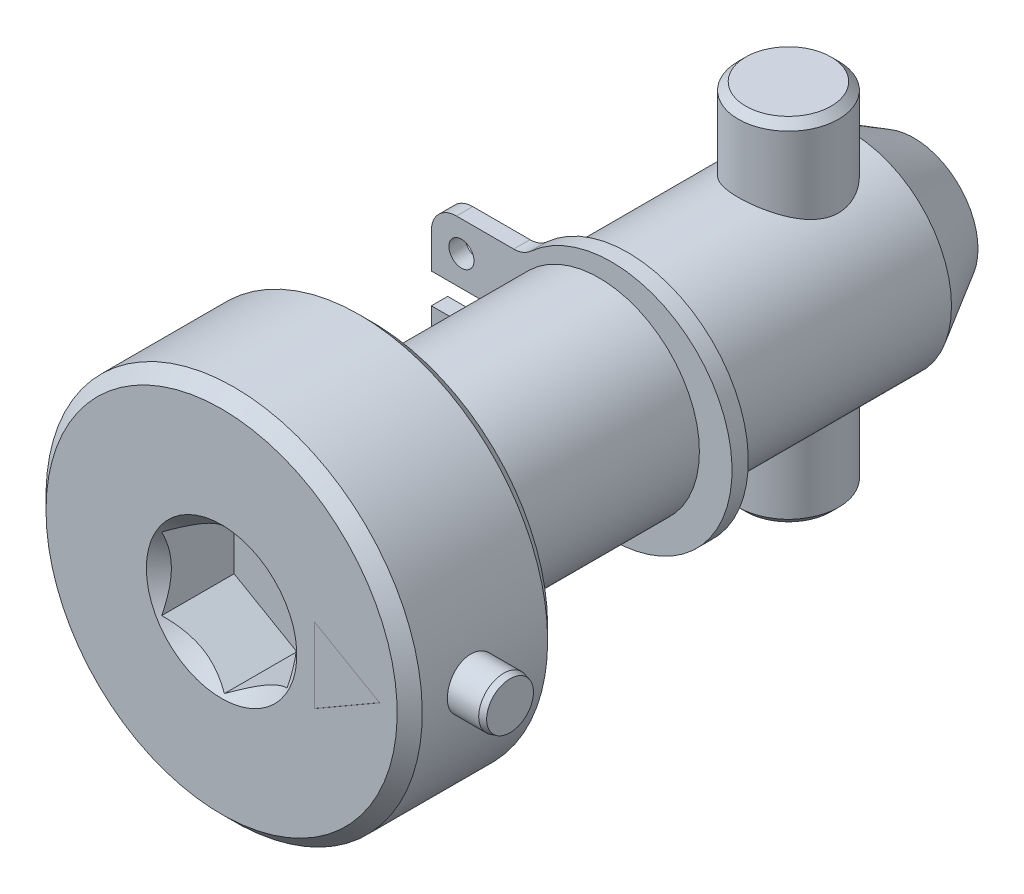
ISO-10303-21;
HEADER;
FILE_DESCRIPTION(('STEP AP214'),'2;1');
FILE_NAME('part.step','',(''),(''),'','','');
FILE_SCHEMA(('AUTOMOTIVE_DESIGN { 1 0 10303 214 1 1 1 1 }'));
ENDSEC;
DATA;
#1=APPLICATION_CONTEXT('core data for automotive mechanical design processes');
#2=APPLICATION_PROTOCOL_DEFINITION('international standard','automotive_design',2000,#1);
#3=PRODUCT_CONTEXT('',#1,'mechanical');
#4=PRODUCT('Part','Part','',(#3));
#5=PRODUCT_RELATED_PRODUCT_CATEGORY('part','',(#4));
#6=PRODUCT_DEFINITION_FORMATION('','',#4);
#7=PRODUCT_DEFINITION_CONTEXT('part definition',#1,'design');
#8=PRODUCT_DEFINITION('design','',#6,#7);
#9=PRODUCT_DEFINITION_SHAPE('','',#8);
#10=(LENGTH_UNIT() NAMED_UNIT(*) SI_UNIT(.MILLI.,.METRE.));
#11=(NAMED_UNIT(*) PLANE_ANGLE_UNIT() SI_UNIT($,.RADIAN.));
#12=(NAMED_UNIT(*) SI_UNIT($,.STERADIAN.) SOLID_ANGLE_UNIT());
#13=UNCERTAINTY_MEASURE_WITH_UNIT(LENGTH_MEASURE(1.E-05),#10,'distance_accuracy_value','');
#14=(GEOMETRIC_REPRESENTATION_CONTEXT(3) GLOBAL_UNCERTAINTY_ASSIGNED_CONTEXT((#13)) GLOBAL_UNIT_ASSIGNED_CONTEXT((#10,
#11,#12)) REPRESENTATION_CONTEXT('',''));
#15=CARTESIAN_POINT('',(0.,0.,0.));
#16=DIRECTION('',(0.,0.,1.));
#17=DIRECTION('',(1.,0.,0.));
#18=AXIS2_PLACEMENT_3D('',#15,#16,#17);
#19=CARTESIAN_POINT('',(0.,0.,6.17));
#20=DIRECTION('',(0.,0.,1.));
#21=DIRECTION('',(0.,1.,0.));
#22=AXIS2_PLACEMENT_3D('',#19,#20,#21);
#23=CYLINDRICAL_SURFACE('',#22,7.5);
#24=CARTESIAN_POINT('',(7.5,0.,9.17));
#25=CARTESIAN_POINT('',(7.49999917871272,-0.0559044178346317,9.16999764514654));
#26=CARTESIAN_POINT('',(7.49936835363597,-0.11184298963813,9.16529623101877));
#27=CARTESIAN_POINT('',(7.49691255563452,-0.222161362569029,9.14661682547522));
#28=CARTESIAN_POINT('',(7.49508636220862,-0.276539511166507,9.13262935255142));
#29=CARTESIAN_POINT('',(7.49044539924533,-0.382124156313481,9.09579914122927));
#30=CARTESIAN_POINT('',(7.48763132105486,-0.433332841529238,9.07296259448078));
#31=CARTESIAN_POINT('',(7.48132693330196,-0.531181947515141,9.01909654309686));
#32=CARTESIAN_POINT('',(7.47783673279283,-0.577823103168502,8.98806835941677));
#33=CARTESIAN_POINT('',(7.47054497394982,-0.665512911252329,8.91849336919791));
#34=CARTESIAN_POINT('',(7.46674179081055,-0.706528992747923,8.87990567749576));
#35=CARTESIAN_POINT('',(7.45926568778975,-0.781523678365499,8.79639490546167));
#36=CARTESIAN_POINT('',(7.45559277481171,-0.815501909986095,8.75147149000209));
#37=CARTESIAN_POINT('',(7.44877717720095,-0.875579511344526,8.65635043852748));
#38=CARTESIAN_POINT('',(7.44563658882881,-0.90164803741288,8.60613315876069));
#39=CARTESIAN_POINT('',(7.44026293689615,-0.944969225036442,8.50198446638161));
#40=CARTESIAN_POINT('',(7.43802983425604,-0.962222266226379,8.44805321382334));
#41=CARTESIAN_POINT('',(7.43473968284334,-0.987323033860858,8.33834709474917));
#42=CARTESIAN_POINT('',(7.43367572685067,-0.995226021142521,8.28258508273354));
#43=CARTESIAN_POINT('',(7.43282325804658,-1.00157340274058,8.17051691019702));
#44=CARTESIAN_POINT('',(7.43303468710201,-1.000018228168,8.11421077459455));
#45=CARTESIAN_POINT('',(7.43470277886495,-0.987538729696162,8.00303943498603));
#46=CARTESIAN_POINT('',(7.43615132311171,-0.976675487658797,7.94816723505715));
#47=CARTESIAN_POINT('',(7.44011776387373,-0.945983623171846,7.84103158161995));
#48=CARTESIAN_POINT('',(7.44263568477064,-0.926154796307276,7.78876818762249));
#49=CARTESIAN_POINT('',(7.44846630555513,-0.878029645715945,7.6881451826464));
#50=CARTESIAN_POINT('',(7.45178147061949,-0.849706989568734,7.63979831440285));
#51=CARTESIAN_POINT('',(7.45883118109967,-0.785416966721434,7.54852045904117));
#52=CARTESIAN_POINT('',(7.46256574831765,-0.749449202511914,7.50558975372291));
#53=CARTESIAN_POINT('',(7.47006949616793,-0.670552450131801,7.42600849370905));
#54=CARTESIAN_POINT('',(7.47383871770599,-0.62757085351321,7.38941007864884));
#55=CARTESIAN_POINT('',(7.48095961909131,-0.536047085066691,7.3239389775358));
#56=CARTESIAN_POINT('',(7.48431129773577,-0.487504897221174,7.29506631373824));
#57=CARTESIAN_POINT('',(7.49022196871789,-0.386196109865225,7.24586544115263));
#58=CARTESIAN_POINT('',(7.49278063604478,-0.333427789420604,7.22554073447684));
#59=CARTESIAN_POINT('',(7.49681412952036,-0.225185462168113,7.19405534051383));
#60=CARTESIAN_POINT('',(7.49828901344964,-0.169711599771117,7.1828941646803));
#61=CARTESIAN_POINT('',(7.49998120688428,-0.0580834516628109,7.17012078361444));
#62=CARTESIAN_POINT('',(7.50020796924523,-0.00193751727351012,7.16843679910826));
#63=CARTESIAN_POINT('',(7.49940395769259,0.10983580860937,7.17447583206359));
#64=CARTESIAN_POINT('',(7.49837321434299,0.165463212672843,7.18219862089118));
#65=CARTESIAN_POINT('',(7.4951758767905,0.27440685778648,7.20677232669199));
#66=CARTESIAN_POINT('',(7.49301357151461,0.327731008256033,7.22358878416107));
#67=CARTESIAN_POINT('',(7.48779504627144,0.43080254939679,7.26583648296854));
#68=CARTESIAN_POINT('',(7.4847387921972,0.480549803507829,7.29126805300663));
#69=CARTESIAN_POINT('',(7.47804918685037,0.57537443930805,7.35019607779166));
#70=CARTESIAN_POINT('',(7.47441257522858,0.620422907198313,7.38373868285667));
#71=CARTESIAN_POINT('',(7.46697864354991,0.704276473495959,7.45787166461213));
#72=CARTESIAN_POINT('',(7.4631813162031,0.743081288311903,7.49846236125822));
#73=CARTESIAN_POINT('',(7.45582451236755,0.8136027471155,7.58585657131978));
#74=CARTESIAN_POINT('',(7.45226674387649,0.8452716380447,7.63269878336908));
#75=CARTESIAN_POINT('',(7.44582066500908,0.900291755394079,7.73107970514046));
#76=CARTESIAN_POINT('',(7.44293233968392,0.923643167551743,7.78261830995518));
#77=CARTESIAN_POINT('',(7.43816405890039,0.961289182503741,7.88877862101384));
#78=CARTESIAN_POINT('',(7.43628117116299,0.975610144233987,7.9433908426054));
#79=CARTESIAN_POINT('',(7.43372874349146,0.994873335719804,8.05427181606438));
#80=CARTESIAN_POINT('',(7.43305913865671,0.999816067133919,8.11054047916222));
#81=CARTESIAN_POINT('',(7.43301115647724,1.00017242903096,8.22266174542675));
#82=CARTESIAN_POINT('',(7.4336226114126,0.995661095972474,8.27851412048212));
#83=CARTESIAN_POINT('',(7.43604591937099,0.977396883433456,8.38865893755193));
#84=CARTESIAN_POINT('',(7.43785777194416,0.963644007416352,8.44295138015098));
#85=CARTESIAN_POINT('',(7.44247445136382,0.927311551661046,8.54842184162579));
#86=CARTESIAN_POINT('',(7.445278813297,0.904736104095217,8.59960130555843));
#87=CARTESIAN_POINT('',(7.45156522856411,0.851406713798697,8.69745794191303));
#88=CARTESIAN_POINT('',(7.45504729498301,0.820652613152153,8.74413502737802));
#89=CARTESIAN_POINT('',(7.46232983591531,0.751562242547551,8.83204482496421));
#90=CARTESIAN_POINT('',(7.46613252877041,0.713170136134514,8.87323347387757));
#91=CARTESIAN_POINT('',(7.47360859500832,0.630010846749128,8.94861160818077));
#92=CARTESIAN_POINT('',(7.47728193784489,0.585242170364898,8.98279944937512));
#93=CARTESIAN_POINT('',(7.48410317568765,0.490376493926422,9.04333356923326));
#94=CARTESIAN_POINT('',(7.48724873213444,0.440257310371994,9.06964533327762));
#95=CARTESIAN_POINT('',(7.49263660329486,0.336296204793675,9.11344029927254));
#96=CARTESIAN_POINT('',(7.49487988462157,0.282458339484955,9.13093295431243));
#97=CARTESIAN_POINT('',(7.49767860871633,0.19029420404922,9.15247400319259));
#98=CARTESIAN_POINT('',(7.49854481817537,0.1525455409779,9.15903662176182));
#99=CARTESIAN_POINT('',(7.49970579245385,0.0765365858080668,9.16780040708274));
#100=CARTESIAN_POINT('',(7.500000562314,0.038276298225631,9.1700016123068));
#101=CARTESIAN_POINT('',(7.5,0.,9.17));
#102=B_SPLINE_CURVE_WITH_KNOTS('',3,(#24,#25,#26,#27,#28,#29,#30,#31,#32,#33,#34,#35,#36,#37,
#38,#39,#40,#41,#42,#43,#44,#45,#46,#47,#48,#49,#50,#51,#52,#53,#54,#55,#56,#57,#58,#59,#60,#61,
#62,#63,#64,#65,#66,#67,#68,#69,#70,#71,#72,#73,#74,#75,#76,#77,#78,#79,#80,#81,#82,#83,#84,#85,
#86,#87,#88,#89,#90,#91,#92,#93,#94,#95,#96,#97,#98,#99,#100,#101),.UNSPECIFIED.,.T.,.F.,(4,2,2,
2,2,2,2,2,2,2,2,2,2,2,2,2,2,2,2,2,2,2,2,2,2,2,2,2,2,2,2,2,2,2,2,2,2,2,4),(0.,0.167573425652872,
0.335318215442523,0.502945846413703,0.670546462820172,0.839079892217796,1.00762223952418,
1.17681360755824,1.34599768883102,1.51417677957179,1.6823482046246,1.84942442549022,
2.01650445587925,2.18410791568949,2.35172009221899,2.52065272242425,2.68958583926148,
2.85858810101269,3.02758135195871,3.1952929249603,3.36300042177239,3.53007681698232,
3.69715958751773,3.86521637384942,4.03328079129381,4.20243852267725,4.37159247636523,
4.54025037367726,4.70889924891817,4.87621463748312,5.04352996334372,5.2107670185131,
5.37800730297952,5.54651833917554,5.7150689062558,5.88434763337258,6.05344452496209,
6.16817869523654,6.28291185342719),.UNSPECIFIED.);
#103=CARTESIAN_POINT('',(7.5,0.,9.17));
#104=VERTEX_POINT('',#103);
#105=EDGE_CURVE('E21',#104,#104,#102,.T.);
#106=ORIENTED_EDGE('',*,*,#105,.F.);
#107=EDGE_LOOP('',(#106));
#108=FACE_BOUND('',#107,.T.);
#109=CARTESIAN_POINT('',(0.,0.,10.17));
#110=DIRECTION('',(0.,0.,1.));
#111=DIRECTION('',(0.,1.,0.));
#112=AXIS2_PLACEMENT_3D('',#109,#110,#111);
#113=CIRCLE('',#112,7.5);
#114=CARTESIAN_POINT('',(0.,7.50000000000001,10.17));
#115=VERTEX_POINT('',#114);
#116=EDGE_CURVE('E196',#115,#115,#113,.T.);
#117=ORIENTED_EDGE('',*,*,#116,.F.);
#118=EDGE_LOOP('',(#117));
#119=FACE_BOUND('',#118,.T.);
#120=CARTESIAN_POINT('',(0.,0.,5.17));
#121=DIRECTION('',(0.,0.,-1.));
#122=DIRECTION('',(1.,0.,0.));
#123=AXIS2_PLACEMENT_3D('',#120,#121,#122);
#124=CIRCLE('',#123,7.5);
#125=CARTESIAN_POINT('',(7.5,0.,5.17));
#126=VERTEX_POINT('',#125);
#127=EDGE_CURVE('E214',#126,#126,#124,.F.);
#128=ORIENTED_EDGE('',*,*,#127,.T.);
#129=EDGE_LOOP('',(#128));
#130=FACE_BOUND('',#129,.T.);
#131=ADVANCED_FACE('F17',(#108,#119,#130),#23,.T.);
#132=CARTESIAN_POINT('',(4.,0.,8.17));
#133=DIRECTION('',(1.,0.,0.));
#134=DIRECTION('',(0.,0.,1.));
#135=AXIS2_PLACEMENT_3D('',#132,#133,#134);
#136=CYLINDRICAL_SURFACE('',#135,1.);
#137=ORIENTED_EDGE('',*,*,#105,.T.);
#138=EDGE_LOOP('',(#137));
#139=FACE_BOUND('',#138,.T.);
#140=CARTESIAN_POINT('',(8.75,0.,8.17));
#141=DIRECTION('',(-1.,0.,0.));
#142=DIRECTION('',(0.,0.,-1.));
#143=AXIS2_PLACEMENT_3D('',#140,#141,#142);
#144=CIRCLE('',#143,1.);
#145=CARTESIAN_POINT('',(8.75,0.,7.17));
#146=VERTEX_POINT('',#145);
#147=EDGE_CURVE('E30',#146,#146,#144,.T.);
#148=ORIENTED_EDGE('',*,*,#147,.T.);
#149=EDGE_LOOP('',(#148));
#150=FACE_BOUND('',#149,.T.);
#151=ADVANCED_FACE('F206',(#139,#150),#136,.T.);
#152=CARTESIAN_POINT('',(9.,0.,8.17));
#153=DIRECTION('',(-1.,0.,0.));
#154=DIRECTION('',(0.,0.,-1.));
#155=AXIS2_PLACEMENT_3D('',#152,#153,#154);
#156=PLANE('',#155);
#157=CARTESIAN_POINT('',(9.,0.,8.17));
#158=DIRECTION('',(-1.,0.,0.));
#159=DIRECTION('',(0.,0.,-1.));
#160=AXIS2_PLACEMENT_3D('',#157,#158,#159);
#161=CIRCLE('',#160,0.93301270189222);
#162=CARTESIAN_POINT('',(9.,0.,7.23698729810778));
#163=VERTEX_POINT('',#162);
#164=EDGE_CURVE('E11',#163,#163,#161,.F.);
#165=ORIENTED_EDGE('',*,*,#164,.T.);
#166=EDGE_LOOP('',(#165));
#167=FACE_BOUND('',#166,.T.);
#168=ADVANCED_FACE('F642',(#167),#156,.F.);
#169=CARTESIAN_POINT('',(8.75,0.,8.17));
#170=DIRECTION('',(-1.,0.,0.));
#171=DIRECTION('',(0.,0.,-1.));
#172=AXIS2_PLACEMENT_3D('',#169,#170,#171);
#173=CONICAL_SURFACE('',#172,1.,0.261799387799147);
#174=ORIENTED_EDGE('',*,*,#164,.F.);
#175=EDGE_LOOP('',(#174));
#176=FACE_BOUND('',#175,.T.);
#177=ORIENTED_EDGE('',*,*,#147,.F.);
#178=EDGE_LOOP('',(#177));
#179=FACE_BOUND('',#178,.T.);
#180=ADVANCED_FACE('F19',(#176,#179),#173,.T.);
#181=CARTESIAN_POINT('',(0.,-2.88675134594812,7.67));
#182=DIRECTION('',(0.,0.,1.));
#183=DIRECTION('',(-1.,0.,0.));
#184=AXIS2_PLACEMENT_3D('',#181,#182,#183);
#185=PLANE('',#184);
#186=DIRECTION('',(0.866025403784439,-0.5,0.));
#187=VECTOR('',#186,1.);
#188=CARTESIAN_POINT('',(-2.5,-1.44337567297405,7.67));
#189=LINE('',#188,#187);
#190=CARTESIAN_POINT('',(-2.5,-1.44337567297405,7.67));
#191=VERTEX_POINT('',#190);
#192=CARTESIAN_POINT('',(0.,-2.88675134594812,7.67));
#193=VERTEX_POINT('',#192);
#194=EDGE_CURVE('E270',#191,#193,#189,.T.);
#195=ORIENTED_EDGE('',*,*,#194,.T.);
#196=DIRECTION('',(0.866025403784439,0.5,0.));
#197=VECTOR('',#196,1.);
#198=CARTESIAN_POINT('',(0.,-2.88675134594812,7.67));
#199=LINE('',#198,#197);
#200=CARTESIAN_POINT('',(2.5,-1.44337567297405,7.67));
#201=VERTEX_POINT('',#200);
#202=EDGE_CURVE('E267',#193,#201,#199,.T.);
#203=ORIENTED_EDGE('',*,*,#202,.T.);
#204=DIRECTION('',(0.,1.,0.));
#205=VECTOR('',#204,1.);
#206=CARTESIAN_POINT('',(2.5,-1.44337567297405,7.67));
#207=LINE('',#206,#205);
#208=CARTESIAN_POINT('',(2.5,1.44337567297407,7.67));
#209=VERTEX_POINT('',#208);
#210=EDGE_CURVE('E264',#201,#209,#207,.T.);
#211=ORIENTED_EDGE('',*,*,#210,.T.);
#212=DIRECTION('',(-0.866025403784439,0.5,0.));
#213=VECTOR('',#212,1.);
#214=CARTESIAN_POINT('',(2.5,1.44337567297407,7.67));
#215=LINE('',#214,#213);
#216=CARTESIAN_POINT('',(0.,2.88675134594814,7.67));
#217=VERTEX_POINT('',#216);
#218=EDGE_CURVE('E261',#209,#217,#215,.T.);
#219=ORIENTED_EDGE('',*,*,#218,.T.);
#220=DIRECTION('',(-0.866025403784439,-0.5,0.));
#221=VECTOR('',#220,1.);
#222=CARTESIAN_POINT('',(0.,2.88675134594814,7.67));
#223=LINE('',#222,#221);
#224=CARTESIAN_POINT('',(-2.5,1.44337567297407,7.67));
#225=VERTEX_POINT('',#224);
#226=EDGE_CURVE('E258',#217,#225,#223,.T.);
#227=ORIENTED_EDGE('',*,*,#226,.T.);
#228=DIRECTION('',(0.,-1.,0.));
#229=VECTOR('',#228,1.);
#230=CARTESIAN_POINT('',(-2.5,1.44337567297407,7.67));
#231=LINE('',#230,#229);
#232=EDGE_CURVE('E241',#225,#191,#231,.T.);
#233=ORIENTED_EDGE('',*,*,#232,.T.);
#234=EDGE_LOOP('',(#195,#203,#211,#219,#227,#233));
#235=FACE_BOUND('',#234,.T.);
#236=ADVANCED_FACE('F300',(#235),#185,.T.);
#237=CARTESIAN_POINT('',(-2.5,-1.44337567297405,7.67));
#238=DIRECTION('',(-0.5,-0.866025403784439,0.));
#239=DIRECTION('',(0.866025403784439,-0.5,0.));
#240=AXIS2_PLACEMENT_3D('',#237,#238,#239);
#241=PLANE('',#240);
#242=DIRECTION('',(0.,0.,1.));
#243=VECTOR('',#242,1.);
#244=CARTESIAN_POINT('',(-2.5,-1.44337567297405,7.67));
#245=LINE('',#244,#243);
#246=CARTESIAN_POINT('',(-2.5,-1.44337567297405,10.5567513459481));
#247=VERTEX_POINT('',#246);
#248=EDGE_CURVE('E237',#191,#247,#245,.T.);
#249=ORIENTED_EDGE('',*,*,#248,.T.);
#250=CARTESIAN_POINT('',(-2.5002,-1.44326020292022,10.5568668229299));
#251=CARTESIAN_POINT('',(-2.41426172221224,-1.49287669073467,10.5072920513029));
#252=CARTESIAN_POINT('',(-2.32688643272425,-1.54332283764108,10.4606288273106));
#253=CARTESIAN_POINT('',(-2.14871854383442,-1.64618811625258,10.3751894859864));
#254=CARTESIAN_POINT('',(-2.05790899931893,-1.69861703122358,10.3364609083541));
#255=CARTESIAN_POINT('',(-1.87479587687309,-1.80433744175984,10.2701180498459));
#256=CARTESIAN_POINT('',(-1.78253893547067,-1.85760201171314,10.242337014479));
#257=CARTESIAN_POINT('',(-1.59599399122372,-1.96530378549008,10.1995345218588));
#258=CARTESIAN_POINT('',(-1.50171168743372,-2.01973769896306,10.1844811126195));
#259=CARTESIAN_POINT('',(-1.33922174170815,-2.11355131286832,10.1708990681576));
#260=CARTESIAN_POINT('',(-1.27122403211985,-2.1528098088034,10.1688884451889));
#261=CARTESIAN_POINT('',(-1.13533975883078,-2.23126263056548,10.1722754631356));
#262=CARTESIAN_POINT('',(-1.06745324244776,-2.27045692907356,10.1776757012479));
#263=CARTESIAN_POINT('',(-0.932321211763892,-2.34847544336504,10.1955771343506));
#264=CARTESIAN_POINT('',(-0.865076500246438,-2.38729919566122,10.2080862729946));
#265=CARTESIAN_POINT('',(-0.7317498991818,-2.46427534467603,10.2395188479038));
#266=CARTESIAN_POINT('',(-0.665667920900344,-2.50242779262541,10.2584417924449));
#267=CARTESIAN_POINT('',(-0.496403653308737,-2.60015256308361,10.3146187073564));
#268=CARTESIAN_POINT('',(-0.394270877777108,-2.65911894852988,10.3561071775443));
#269=CARTESIAN_POINT('',(-0.24409358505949,-2.74582384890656,10.4261453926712));
#270=CARTESIAN_POINT('',(-0.194603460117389,-2.77439698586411,10.4507535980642));
#271=CARTESIAN_POINT('',(-0.0965399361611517,-2.83101398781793,10.5022132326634));
#272=CARTESIAN_POINT('',(-0.0479659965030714,-2.85905816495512,10.5290632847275));
#273=CARTESIAN_POINT('',(0.000199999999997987,-2.88686681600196,10.5568668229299));
#274=B_SPLINE_CURVE_WITH_KNOTS('',3,(#250,#251,#252,#253,#254,#255,#256,#257,#258,#259,#260,
#261,#262,#263,#264,#265,#266,#267,#268,#269,#270,#271,#272,#273),.UNSPECIFIED.,.F.,.F.,(4,2,2,
2,2,2,2,2,2,2,2,4),(0.,0.333012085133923,0.667964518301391,0.997597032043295,1.32639954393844,
1.56169424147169,1.79707142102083,2.03271213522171,2.26833478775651,2.64260240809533,
2.82922877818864,3.01574133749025),.UNSPECIFIED.);
#275=CARTESIAN_POINT('',(0.,-2.88675134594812,10.5567513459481));
#276=VERTEX_POINT('',#275);
#277=EDGE_CURVE('E273',#247,#276,#274,.T.);
#278=ORIENTED_EDGE('',*,*,#277,.T.);
#279=DIRECTION('',(0.,0.,1.));
#280=VECTOR('',#279,1.);
#281=CARTESIAN_POINT('',(0.,-2.88675134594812,7.67));
#282=LINE('',#281,#280);
#283=EDGE_CURVE('E238',#193,#276,#282,.T.);
#284=ORIENTED_EDGE('',*,*,#283,.F.);
#285=ORIENTED_EDGE('',*,*,#194,.F.);
#286=EDGE_LOOP('',(#249,#278,#284,#285));
#287=FACE_BOUND('',#286,.T.);
#288=ADVANCED_FACE('F288',(#287),#241,.F.);
#289=CARTESIAN_POINT('',(0.,-2.88675134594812,7.67));
#290=DIRECTION('',(0.5,-0.866025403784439,0.));
#291=DIRECTION('',(0.866025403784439,0.5,0.));
#292=AXIS2_PLACEMENT_3D('',#289,#290,#291);
#293=PLANE('',#292);
#294=ORIENTED_EDGE('',*,*,#283,.T.);
#295=CARTESIAN_POINT('',(-0.000200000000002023,-2.88686681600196,10.5568668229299));
#296=CARTESIAN_POINT('',(0.0857382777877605,-2.8372503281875,10.5072920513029));
#297=CARTESIAN_POINT('',(0.173113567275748,-2.78680418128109,10.4606288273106));
#298=CARTESIAN_POINT('',(0.351281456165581,-2.6839389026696,10.3751894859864));
#299=CARTESIAN_POINT('',(0.442091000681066,-2.63150998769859,10.3364609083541));
#300=CARTESIAN_POINT('',(0.625204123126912,-2.52578957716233,10.2701180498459));
#301=CARTESIAN_POINT('',(0.717461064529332,-2.47252500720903,10.242337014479));
#302=CARTESIAN_POINT('',(0.90400600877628,-2.36482323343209,10.1995345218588));
#303=CARTESIAN_POINT('',(0.998288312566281,-2.31038931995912,10.1844811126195));
#304=CARTESIAN_POINT('',(1.16077825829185,-2.21657570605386,10.1708990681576));
#305=CARTESIAN_POINT('',(1.22877596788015,-2.17731721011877,10.1688884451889));
#306=CARTESIAN_POINT('',(1.36466024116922,-2.09886438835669,10.1722754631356));
#307=CARTESIAN_POINT('',(1.43254675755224,-2.05967008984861,10.1776757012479));
#308=CARTESIAN_POINT('',(1.56767878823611,-1.98165157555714,10.1955771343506));
#309=CARTESIAN_POINT('',(1.63492349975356,-1.94282782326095,10.2080862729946));
#310=CARTESIAN_POINT('',(1.7682501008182,-1.86585167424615,10.2395188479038));
#311=CARTESIAN_POINT('',(1.83433207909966,-1.82769922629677,10.2584417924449));
#312=CARTESIAN_POINT('',(2.00359634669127,-1.72997445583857,10.3146187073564));
#313=CARTESIAN_POINT('',(2.10572912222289,-1.6710080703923,10.3561071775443));
#314=CARTESIAN_POINT('',(2.25590641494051,-1.58430317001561,10.4261453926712));
#315=CARTESIAN_POINT('',(2.30539653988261,-1.55573003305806,10.4507535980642));
#316=CARTESIAN_POINT('',(2.40346006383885,-1.49911303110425,10.5022132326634));
#317=CARTESIAN_POINT('',(2.45203400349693,-1.47106885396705,10.5290632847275));
#318=CARTESIAN_POINT('',(2.5002,-1.44326020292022,10.5568668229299));
#319=B_SPLINE_CURVE_WITH_KNOTS('',3,(#295,#296,#297,#298,#299,#300,#301,#302,#303,#304,#305,
#306,#307,#308,#309,#310,#311,#312,#313,#314,#315,#316,#317,#318),.UNSPECIFIED.,.F.,.F.,(4,2,2,
2,2,2,2,2,2,2,2,4),(0.,0.333012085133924,0.667964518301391,0.997597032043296,1.32639954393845,
1.56169424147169,1.79707142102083,2.03271213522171,2.26833478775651,2.64260240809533,
2.82922877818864,3.01574133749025),.UNSPECIFIED.);
#320=CARTESIAN_POINT('',(2.5,-1.44337567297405,10.5567513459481));
#321=VERTEX_POINT('',#320);
#322=EDGE_CURVE('E46',#276,#321,#319,.T.);
#323=ORIENTED_EDGE('',*,*,#322,.T.);
#324=DIRECTION('',(0.,0.,1.));
#325=VECTOR('',#324,1.);
#326=CARTESIAN_POINT('',(2.5,-1.44337567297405,7.67));
#327=LINE('',#326,#325);
#328=EDGE_CURVE('E242',#201,#321,#327,.T.);
#329=ORIENTED_EDGE('',*,*,#328,.F.);
#330=ORIENTED_EDGE('',*,*,#202,.F.);
#331=EDGE_LOOP('',(#294,#323,#329,#330));
#332=FACE_BOUND('',#331,.T.);
#333=ADVANCED_FACE('F681',(#332),#293,.F.);
#334=CARTESIAN_POINT('',(2.5,-1.44337567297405,7.67));
#335=DIRECTION('',(1.,0.,0.));
#336=DIRECTION('',(0.,1.,0.));
#337=AXIS2_PLACEMENT_3D('',#334,#335,#336);
#338=PLANE('',#337);
#339=ORIENTED_EDGE('',*,*,#328,.T.);
#340=CARTESIAN_POINT('',(2.5,2.95728551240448,11.5424072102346));
#341=CARTESIAN_POINT('',(2.5,2.88562213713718,11.4876915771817));
#342=CARTESIAN_POINT('',(2.5,2.81356645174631,11.4334815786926));
#343=CARTESIAN_POINT('',(2.5,2.66851237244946,11.3263019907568));
#344=CARTESIAN_POINT('',(2.5,2.59551375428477,11.2733327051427));
#345=CARTESIAN_POINT('',(2.5,2.4478818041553,11.1684866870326));
#346=CARTESIAN_POINT('',(2.5,2.37324019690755,11.1166215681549));
#347=CARTESIAN_POINT('',(2.5,2.22270431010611,11.0147483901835));
#348=CARTESIAN_POINT('',(2.5,2.14681011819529,10.9647402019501));
#349=CARTESIAN_POINT('',(2.5,1.98889031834,10.8640196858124));
#350=CARTESIAN_POINT('',(2.5,1.90677303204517,10.8134503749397));
#351=CARTESIAN_POINT('',(2.5,1.74063830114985,10.7155406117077));
#352=CARTESIAN_POINT('',(2.5,1.65662110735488,10.6681997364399));
#353=CARTESIAN_POINT('',(2.5,1.48664028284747,10.5777372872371));
#354=CARTESIAN_POINT('',(2.5,1.40068299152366,10.5346038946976));
#355=CARTESIAN_POINT('',(2.5,1.22637269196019,10.4535304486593));
#356=CARTESIAN_POINT('',(2.5,1.13802081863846,10.4155879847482));
#357=CARTESIAN_POINT('',(2.5,0.966951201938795,10.349432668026));
#358=CARTESIAN_POINT('',(2.5,0.884457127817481,10.320647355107));
#359=CARTESIAN_POINT('',(2.5,0.717414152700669,10.2696851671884));
#360=CARTESIAN_POINT('',(2.5,0.632865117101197,10.2475087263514));
#361=CARTESIAN_POINT('',(2.5,0.463662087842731,10.2113162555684));
#362=CARTESIAN_POINT('',(2.5,0.379039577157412,10.197155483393));
#363=CARTESIAN_POINT('',(2.5,0.20880294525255,10.1772818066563));
#364=CARTESIAN_POINT('',(2.5,0.123189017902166,10.1715672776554));
#365=CARTESIAN_POINT('',(2.5,-0.0446995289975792,10.1690475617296));
#366=CARTESIAN_POINT('',(2.5,-0.1269689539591,10.171890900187));
#367=CARTESIAN_POINT('',(2.5,-0.290840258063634,10.1855351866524));
#368=CARTESIAN_POINT('',(2.5,-0.372442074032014,10.1963368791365));
#369=CARTESIAN_POINT('',(2.5,-0.535771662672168,10.2254787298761));
#370=CARTESIAN_POINT('',(2.5,-0.617475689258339,10.2439499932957));
#371=CARTESIAN_POINT('',(2.5,-0.77908452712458,10.2874255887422));
#372=CARTESIAN_POINT('',(2.5,-0.858989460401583,10.3124294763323));
#373=CARTESIAN_POINT('',(2.5,-1.10711347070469,10.3995668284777));
#374=CARTESIAN_POINT('',(2.5,-1.27191032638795,10.4714787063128));
#375=CARTESIAN_POINT('',(2.5,-1.51308713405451,10.5913993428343));
#376=CARTESIAN_POINT('',(2.5,-1.59262516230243,10.6334753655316));
#377=CARTESIAN_POINT('',(2.5,-1.74989828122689,10.7208793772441));
#378=CARTESIAN_POINT('',(2.5,-1.82763368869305,10.7662067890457));
#379=CARTESIAN_POINT('',(2.5,-1.97770400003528,10.8571510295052));
#380=CARTESIAN_POINT('',(2.5,-2.0501157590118,10.9026424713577));
#381=CARTESIAN_POINT('',(2.5,-2.19369710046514,10.995554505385));
#382=CARTESIAN_POINT('',(2.5,-2.2648665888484,11.0429752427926));
#383=CARTESIAN_POINT('',(2.5,-2.40555001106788,11.1390121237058));
#384=CARTESIAN_POINT('',(2.5,-2.47507266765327,11.1876155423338));
#385=CARTESIAN_POINT('',(2.5,-2.61316551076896,11.2861189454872));
#386=CARTESIAN_POINT('',(2.5,-2.68173595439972,11.3360185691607));
#387=CARTESIAN_POINT('',(2.5,-2.74990741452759,11.3864486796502));
#388=B_SPLINE_CURVE_WITH_KNOTS('',3,(#340,#341,#342,#343,#344,#345,#346,#347,#348,#349,#350,
#351,#352,#353,#354,#355,#356,#357,#358,#359,#360,#361,#362,#363,#364,#365,#366,#367,#368,#369,
#370,#371,#372,#373,#374,#375,#376,#377,#378,#379,#380,#381,#382,#383,#384,#385,#386,#387),
.UNSPECIFIED.,.F.,.F.,(4,2,2,2,2,2,2,2,2,2,2,2,2,2,2,2,2,2,2,2,2,2,2,4),(0.,0.270495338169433,
0.541056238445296,0.813709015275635,1.08634279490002,1.37560163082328,1.66482250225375,
1.95320604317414,2.24145521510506,2.50334359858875,2.7652491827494,3.02226079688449,
3.27922297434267,3.52577758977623,3.77235527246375,4.02333385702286,4.27429537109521,
4.81203557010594,5.08195798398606,5.3518325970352,5.60834857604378,5.86488390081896,
6.11935033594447,6.37374667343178),.UNSPECIFIED.);
#389=CARTESIAN_POINT('',(2.5,1.44337567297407,10.5567513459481));
#390=VERTEX_POINT('',#389);
#391=EDGE_CURVE('E313',#321,#390,#388,.F.);
#392=ORIENTED_EDGE('',*,*,#391,.T.);
#393=DIRECTION('',(0.,0.,1.));
#394=VECTOR('',#393,1.);
#395=CARTESIAN_POINT('',(2.5,1.44337567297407,7.67));
#396=LINE('',#395,#394);
#397=EDGE_CURVE('E245',#209,#390,#396,.T.);
#398=ORIENTED_EDGE('',*,*,#397,.F.);
#399=ORIENTED_EDGE('',*,*,#210,.F.);
#400=EDGE_LOOP('',(#339,#392,#398,#399));
#401=FACE_BOUND('',#400,.T.);
#402=ADVANCED_FACE('F689',(#401),#338,.F.);
#403=CARTESIAN_POINT('',(2.5,1.44337567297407,7.67));
#404=DIRECTION('',(0.5,0.866025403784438,0.));
#405=DIRECTION('',(-0.866025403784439,0.5,0.));
#406=AXIS2_PLACEMENT_3D('',#403,#404,#405);
#407=PLANE('',#406);
#408=ORIENTED_EDGE('',*,*,#397,.T.);
#409=CARTESIAN_POINT('',(2.5002,1.44326020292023,10.5568668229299));
#410=CARTESIAN_POINT('',(2.41426172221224,1.49287669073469,10.5072920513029));
#411=CARTESIAN_POINT('',(2.32688643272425,1.5433228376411,10.4606288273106));
#412=CARTESIAN_POINT('',(2.14871854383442,1.6461881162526,10.3751894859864));
#413=CARTESIAN_POINT('',(2.05790899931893,1.6986170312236,10.3364609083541));
#414=CARTESIAN_POINT('',(1.87479587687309,1.80433744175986,10.2701180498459));
#415=CARTESIAN_POINT('',(1.78253893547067,1.85760201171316,10.242337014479));
#416=CARTESIAN_POINT('',(1.59599399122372,1.9653037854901,10.1995345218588));
#417=CARTESIAN_POINT('',(1.50171168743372,2.01973769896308,10.1844811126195));
#418=CARTESIAN_POINT('',(1.33922174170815,2.11355131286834,10.1708990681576));
#419=CARTESIAN_POINT('',(1.27122403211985,2.15280980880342,10.1688884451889));
#420=CARTESIAN_POINT('',(1.13533975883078,2.2312626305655,10.1722754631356));
#421=CARTESIAN_POINT('',(1.06745324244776,2.27045692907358,10.1776757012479));
#422=CARTESIAN_POINT('',(0.932321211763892,2.34847544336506,10.1955771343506));
#423=CARTESIAN_POINT('',(0.865076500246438,2.38729919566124,10.2080862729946));
#424=CARTESIAN_POINT('',(0.7317498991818,2.46427534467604,10.2395188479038));
#425=CARTESIAN_POINT('',(0.665667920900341,2.50242779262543,10.2584417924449));
#426=CARTESIAN_POINT('',(0.496403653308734,2.60015256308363,10.3146187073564));
#427=CARTESIAN_POINT('',(0.394270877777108,2.65911894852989,10.3561071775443));
#428=CARTESIAN_POINT('',(0.244093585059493,2.74582384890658,10.4261453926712));
#429=CARTESIAN_POINT('',(0.194603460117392,2.77439698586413,10.4507535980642));
#430=CARTESIAN_POINT('',(0.0965399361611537,2.83101398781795,10.5022132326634));
#431=CARTESIAN_POINT('',(0.0479659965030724,2.85905816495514,10.5290632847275));
#432=CARTESIAN_POINT('',(-0.000199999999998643,2.88686681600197,10.5568668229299));
#433=B_SPLINE_CURVE_WITH_KNOTS('',3,(#409,#410,#411,#412,#413,#414,#415,#416,#417,#418,#419,
#420,#421,#422,#423,#424,#425,#426,#427,#428,#429,#430,#431,#432),.UNSPECIFIED.,.F.,.F.,(4,2,2,
2,2,2,2,2,2,2,2,4),(0.,0.333012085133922,0.667964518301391,0.997597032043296,1.32639954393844,
1.56169424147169,1.79707142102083,2.03271213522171,2.26833478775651,2.64260240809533,
2.82922877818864,3.01574133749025),.UNSPECIFIED.);
#434=CARTESIAN_POINT('',(0.,2.88675134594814,10.5567513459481));
#435=VERTEX_POINT('',#434);
#436=EDGE_CURVE('E322',#390,#435,#433,.T.);
#437=ORIENTED_EDGE('',*,*,#436,.T.);
#438=DIRECTION('',(0.,0.,1.));
#439=VECTOR('',#438,1.);
#440=CARTESIAN_POINT('',(0.,2.88675134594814,7.67));
#441=LINE('',#440,#439);
#442=EDGE_CURVE('E248',#217,#435,#441,.T.);
#443=ORIENTED_EDGE('',*,*,#442,.F.);
#444=ORIENTED_EDGE('',*,*,#218,.F.);
#445=EDGE_LOOP('',(#408,#437,#443,#444));
#446=FACE_BOUND('',#445,.T.);
#447=ADVANCED_FACE('F338',(#446),#407,.F.);
#448=CARTESIAN_POINT('',(0.,2.88675134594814,7.67));
#449=DIRECTION('',(-0.5,0.866025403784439,0.));
#450=DIRECTION('',(-0.866025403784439,-0.5,0.));
#451=AXIS2_PLACEMENT_3D('',#448,#449,#450);
#452=PLANE('',#451);
#453=ORIENTED_EDGE('',*,*,#442,.T.);
#454=CARTESIAN_POINT('',(0.000199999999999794,2.88686681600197,10.5568668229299));
#455=CARTESIAN_POINT('',(-0.0857382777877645,2.83725032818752,10.5072920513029));
#456=CARTESIAN_POINT('',(-0.173113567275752,2.78680418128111,10.4606288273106));
#457=CARTESIAN_POINT('',(-0.351281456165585,2.68393890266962,10.3751894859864));
#458=CARTESIAN_POINT('',(-0.44209100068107,2.63150998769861,10.3364609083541));
#459=CARTESIAN_POINT('',(-0.625204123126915,2.52578957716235,10.2701180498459));
#460=CARTESIAN_POINT('',(-0.717461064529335,2.47252500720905,10.242337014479));
#461=CARTESIAN_POINT('',(-0.904006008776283,2.36482323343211,10.1995345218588));
#462=CARTESIAN_POINT('',(-0.998288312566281,2.31038931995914,10.1844811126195));
#463=CARTESIAN_POINT('',(-1.16077825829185,2.21657570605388,10.1708990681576));
#464=CARTESIAN_POINT('',(-1.22877596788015,2.17731721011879,10.1688884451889));
#465=CARTESIAN_POINT('',(-1.36466024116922,2.09886438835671,10.1722754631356));
#466=CARTESIAN_POINT('',(-1.43254675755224,2.05967008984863,10.177675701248));
#467=CARTESIAN_POINT('',(-1.56767878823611,1.98165157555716,10.1955771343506));
#468=CARTESIAN_POINT('',(-1.63492349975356,1.94282782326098,10.2080862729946));
#469=CARTESIAN_POINT('',(-1.7682501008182,1.86585167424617,10.2395188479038));
#470=CARTESIAN_POINT('',(-1.83433207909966,1.82769922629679,10.2584417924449));
#471=CARTESIAN_POINT('',(-2.00359634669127,1.72997445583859,10.3146187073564));
#472=CARTESIAN_POINT('',(-2.10572912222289,1.67100807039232,10.3561071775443));
#473=CARTESIAN_POINT('',(-2.25590641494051,1.58430317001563,10.4261453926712));
#474=CARTESIAN_POINT('',(-2.30539653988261,1.55573003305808,10.4507535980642));
#475=CARTESIAN_POINT('',(-2.40346006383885,1.49911303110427,10.5022132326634));
#476=CARTESIAN_POINT('',(-2.45203400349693,1.47106885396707,10.5290632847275));
#477=CARTESIAN_POINT('',(-2.5002,1.44326020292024,10.5568668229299));
#478=B_SPLINE_CURVE_WITH_KNOTS('',3,(#454,#455,#456,#457,#458,#459,#460,#461,#462,#463,#464,
#465,#466,#467,#468,#469,#470,#471,#472,#473,#474,#475,#476,#477),.UNSPECIFIED.,.F.,.F.,(4,2,2,
2,2,2,2,2,2,2,2,4),(0.,0.333012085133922,0.667964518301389,0.997597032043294,1.32639954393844,
1.56169424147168,1.79707142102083,2.03271213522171,2.2683347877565,2.64260240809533,
2.82922877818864,3.01574133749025),.UNSPECIFIED.);
#479=CARTESIAN_POINT('',(-2.5,1.44337567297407,10.5567513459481));
#480=VERTEX_POINT('',#479);
#481=EDGE_CURVE('E328',#435,#480,#478,.T.);
#482=ORIENTED_EDGE('',*,*,#481,.T.);
#483=DIRECTION('',(0.,0.,1.));
#484=VECTOR('',#483,1.);
#485=CARTESIAN_POINT('',(-2.5,1.44337567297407,7.67));
#486=LINE('',#485,#484);
#487=EDGE_CURVE('E251',#225,#480,#486,.T.);
#488=ORIENTED_EDGE('',*,*,#487,.F.);
#489=ORIENTED_EDGE('',*,*,#226,.F.);
#490=EDGE_LOOP('',(#453,#482,#488,#489));
#491=FACE_BOUND('',#490,.T.);
#492=ADVANCED_FACE('F335',(#491),#452,.F.);
#493=CARTESIAN_POINT('',(-2.5,1.44337567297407,7.67));
#494=DIRECTION('',(-1.,0.,0.));
#495=DIRECTION('',(0.,-1.,0.));
#496=AXIS2_PLACEMENT_3D('',#493,#494,#495);
#497=PLANE('',#496);
#498=ORIENTED_EDGE('',*,*,#487,.T.);
#499=CARTESIAN_POINT('',(-2.5,2.95728551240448,11.5424072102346));
#500=CARTESIAN_POINT('',(-2.5,2.88562213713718,11.4876915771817));
#501=CARTESIAN_POINT('',(-2.5,2.81356645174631,11.4334815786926));
#502=CARTESIAN_POINT('',(-2.5,2.66851237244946,11.3263019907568));
#503=CARTESIAN_POINT('',(-2.5,2.59551375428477,11.2733327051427));
#504=CARTESIAN_POINT('',(-2.5,2.4478818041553,11.1684866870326));
#505=CARTESIAN_POINT('',(-2.5,2.37324019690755,11.1166215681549));
#506=CARTESIAN_POINT('',(-2.5,2.22270431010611,11.0147483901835));
#507=CARTESIAN_POINT('',(-2.5,2.14681011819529,10.9647402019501));
#508=CARTESIAN_POINT('',(-2.5,1.98889031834,10.8640196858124));
#509=CARTESIAN_POINT('',(-2.5,1.90677303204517,10.8134503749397));
#510=CARTESIAN_POINT('',(-2.5,1.74063830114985,10.7155406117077));
#511=CARTESIAN_POINT('',(-2.5,1.65662110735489,10.6681997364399));
#512=CARTESIAN_POINT('',(-2.5,1.48664028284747,10.5777372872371));
#513=CARTESIAN_POINT('',(-2.5,1.40068299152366,10.5346038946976));
#514=CARTESIAN_POINT('',(-2.5,1.2263726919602,10.4535304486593));
#515=CARTESIAN_POINT('',(-2.5,1.13802081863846,10.4155879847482));
#516=CARTESIAN_POINT('',(-2.5,0.966951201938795,10.349432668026));
#517=CARTESIAN_POINT('',(-2.5,0.884457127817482,10.3206473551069));
#518=CARTESIAN_POINT('',(-2.5,0.71741415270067,10.2696851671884));
#519=CARTESIAN_POINT('',(-2.5,0.632865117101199,10.2475087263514));
#520=CARTESIAN_POINT('',(-2.5,0.463662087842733,10.2113162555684));
#521=CARTESIAN_POINT('',(-2.5,0.379039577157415,10.197155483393));
#522=CARTESIAN_POINT('',(-2.5,0.208802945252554,10.1772818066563));
#523=CARTESIAN_POINT('',(-2.5,0.12318901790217,10.1715672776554));
#524=CARTESIAN_POINT('',(-2.5,-0.0446995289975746,10.1690475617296));
#525=CARTESIAN_POINT('',(-2.5,-0.126968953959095,10.171890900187));
#526=CARTESIAN_POINT('',(-2.5,-0.290840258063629,10.1855351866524));
#527=CARTESIAN_POINT('',(-2.5,-0.372442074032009,10.1963368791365));
#528=CARTESIAN_POINT('',(-2.5,-0.535771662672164,10.2254787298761));
#529=CARTESIAN_POINT('',(-2.5,-0.617475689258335,10.2439499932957));
#530=CARTESIAN_POINT('',(-2.5,-0.779084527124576,10.2874255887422));
#531=CARTESIAN_POINT('',(-2.5,-0.858989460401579,10.3124294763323));
#532=CARTESIAN_POINT('',(-2.5,-1.10711347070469,10.3995668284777));
#533=CARTESIAN_POINT('',(-2.5,-1.27191032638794,10.4714787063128));
#534=CARTESIAN_POINT('',(-2.5,-1.51308713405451,10.5913993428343));
#535=CARTESIAN_POINT('',(-2.5,-1.59262516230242,10.6334753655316));
#536=CARTESIAN_POINT('',(-2.5,-1.74989828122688,10.7208793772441));
#537=CARTESIAN_POINT('',(-2.5,-1.82763368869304,10.7662067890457));
#538=CARTESIAN_POINT('',(-2.5,-1.97770400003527,10.8571510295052));
#539=CARTESIAN_POINT('',(-2.5,-2.05011575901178,10.9026424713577));
#540=CARTESIAN_POINT('',(-2.5,-2.19369710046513,10.995554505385));
#541=CARTESIAN_POINT('',(-2.5,-2.26486658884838,11.0429752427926));
#542=CARTESIAN_POINT('',(-2.5,-2.40555001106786,11.1390121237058));
#543=CARTESIAN_POINT('',(-2.5,-2.47507266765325,11.1876155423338));
#544=CARTESIAN_POINT('',(-2.5,-2.61316551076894,11.2861189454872));
#545=CARTESIAN_POINT('',(-2.5,-2.6817359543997,11.3360185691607));
#546=CARTESIAN_POINT('',(-2.5,-2.74990741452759,11.3864486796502));
#547=B_SPLINE_CURVE_WITH_KNOTS('',3,(#499,#500,#501,#502,#503,#504,#505,#506,#507,#508,#509,
#510,#511,#512,#513,#514,#515,#516,#517,#518,#519,#520,#521,#522,#523,#524,#525,#526,#527,#528,
#529,#530,#531,#532,#533,#534,#535,#536,#537,#538,#539,#540,#541,#542,#543,#544,#545,#546),
.UNSPECIFIED.,.F.,.F.,(4,2,2,2,2,2,2,2,2,2,2,2,2,2,2,2,2,2,2,2,2,2,2,4),(0.,0.270495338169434,
0.541056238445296,0.813709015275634,1.08634279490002,1.37560163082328,1.66482250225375,
1.95320604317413,2.24145521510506,2.50334359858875,2.7652491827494,3.02226079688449,
3.27922297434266,3.52577758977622,3.77235527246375,4.02333385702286,4.27429537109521,
4.81203557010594,5.08195798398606,5.35183259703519,5.60834857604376,5.86488390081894,
6.11935033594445,6.37374667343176),.UNSPECIFIED.);
#548=EDGE_CURVE('E281',#480,#247,#547,.T.);
#549=ORIENTED_EDGE('',*,*,#548,.T.);
#550=ORIENTED_EDGE('',*,*,#248,.F.);
#551=ORIENTED_EDGE('',*,*,#232,.F.);
#552=EDGE_LOOP('',(#498,#549,#550,#551));
#553=FACE_BOUND('',#552,.T.);
#554=ADVANCED_FACE('F298',(#553),#497,.F.);
#555=CARTESIAN_POINT('',(0.,0.,10.67));
#556=DIRECTION('',(0.,0.,1.));
#557=DIRECTION('',(-1.,0.,0.));
#558=AXIS2_PLACEMENT_3D('',#555,#556,#557);
#559=CONICAL_SURFACE('',#558,3.,0.78539816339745);
#560=CARTESIAN_POINT('',(0.,0.,10.67));
#561=DIRECTION('',(0.,0.,1.));
#562=DIRECTION('',(-1.,0.,0.));
#563=AXIS2_PLACEMENT_3D('',#560,#561,#562);
#564=CIRCLE('',#563,3.);
#565=CARTESIAN_POINT('',(-3.,0.,10.67));
#566=VERTEX_POINT('',#565);
#567=EDGE_CURVE('E199',#566,#566,#564,.T.);
#568=ORIENTED_EDGE('',*,*,#567,.T.);
#569=EDGE_LOOP('',(#568));
#570=FACE_BOUND('',#569,.T.);
#571=ORIENTED_EDGE('',*,*,#548,.F.);
#572=ORIENTED_EDGE('',*,*,#481,.F.);
#573=ORIENTED_EDGE('',*,*,#436,.F.);
#574=ORIENTED_EDGE('',*,*,#391,.F.);
#575=ORIENTED_EDGE('',*,*,#322,.F.);
#576=ORIENTED_EDGE('',*,*,#277,.F.);
#577=EDGE_LOOP('',(#571,#572,#573,#574,#575,#576));
#578=FACE_BOUND('',#577,.T.);
#579=ADVANCED_FACE('F292',(#570,#578),#559,.F.);
#580=CARTESIAN_POINT('',(0.,0.,10.67));
#581=DIRECTION('',(0.,0.,1.));
#582=DIRECTION('',(-1.,0.,0.));
#583=AXIS2_PLACEMENT_3D('',#580,#581,#582);
#584=PLANE('',#583);
#585=DIRECTION('',(0.,-1.,0.));
#586=VECTOR('',#585,1.);
#587=CARTESIAN_POINT('',(3.7,-1.5,10.67));
#588=LINE('',#587,#586);
#589=CARTESIAN_POINT('',(3.7,1.5,10.67));
#590=VERTEX_POINT('',#589);
#591=CARTESIAN_POINT('',(3.7,-1.5,10.67));
#592=VERTEX_POINT('',#591);
#593=EDGE_CURVE('E1080',#590,#592,#588,.T.);
#594=ORIENTED_EDGE('',*,*,#593,.F.);
#595=DIRECTION('',(-0.866025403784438,0.5,0.));
#596=VECTOR('',#595,1.);
#597=CARTESIAN_POINT('',(3.7,1.5,10.67));
#598=LINE('',#597,#596);
#599=CARTESIAN_POINT('',(6.29807621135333,0.,10.67));
#600=VERTEX_POINT('',#599);
#601=EDGE_CURVE('E1138',#600,#590,#598,.T.);
#602=ORIENTED_EDGE('',*,*,#601,.F.);
#603=DIRECTION('',(0.866025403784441,0.5,0.));
#604=VECTOR('',#603,1.);
#605=CARTESIAN_POINT('',(6.29807621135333,0.,10.67));
#606=LINE('',#605,#604);
#607=EDGE_CURVE('E37',#592,#600,#606,.T.);
#608=ORIENTED_EDGE('',*,*,#607,.F.);
#609=EDGE_LOOP('',(#594,#602,#608));
#610=FACE_BOUND('',#609,.T.);
#611=ORIENTED_EDGE('',*,*,#567,.F.);
#612=EDGE_LOOP('',(#611));
#613=FACE_BOUND('',#612,.T.);
#614=CARTESIAN_POINT('',(0.,0.,10.67));
#615=DIRECTION('',(0.,0.,1.));
#616=DIRECTION('',(-1.,0.,0.));
#617=AXIS2_PLACEMENT_3D('',#614,#615,#616);
#618=CIRCLE('',#617,7.);
#619=CARTESIAN_POINT('',(-7.,0.,10.67));
#620=VERTEX_POINT('',#619);
#621=EDGE_CURVE('E217',#620,#620,#618,.T.);
#622=ORIENTED_EDGE('',*,*,#621,.T.);
#623=EDGE_LOOP('',(#622));
#624=FACE_BOUND('',#623,.T.);
#625=ADVANCED_FACE('F297',(#610,#613,#624),#584,.T.);
#626=CARTESIAN_POINT('',(0.,0.,10.17));
#627=DIRECTION('',(0.,0.,-1.));
#628=DIRECTION('',(1.,0.,0.));
#629=AXIS2_PLACEMENT_3D('',#626,#627,#628);
#630=CONICAL_SURFACE('',#629,7.5,0.785398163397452);
#631=ORIENTED_EDGE('',*,*,#621,.F.);
#632=EDGE_LOOP('',(#631));
#633=FACE_BOUND('',#632,.T.);
#634=ORIENTED_EDGE('',*,*,#116,.T.);
#635=EDGE_LOOP('',(#634));
#636=FACE_BOUND('',#635,.T.);
#637=ADVANCED_FACE('F513',(#633,#636),#630,.T.);
#638=CARTESIAN_POINT('',(0.,0.,-16.93));
#639=DIRECTION('',(0.,0.,-1.));
#640=DIRECTION('',(1.,0.,0.));
#641=AXIS2_PLACEMENT_3D('',#638,#639,#640);
#642=CONICAL_SURFACE('',#641,1.75,0.78539816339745);
#643=CARTESIAN_POINT('',(0.,0.,-16.68));
#644=DIRECTION('',(0.,0.,-1.));
#645=DIRECTION('',(0.,-1.,0.));
#646=AXIS2_PLACEMENT_3D('',#643,#644,#645);
#647=CIRCLE('',#646,1.5);
#648=CARTESIAN_POINT('',(0.,-1.49999999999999,-16.68));
#649=VERTEX_POINT('',#648);
#650=EDGE_CURVE('E555',#649,#649,#647,.T.);
#651=ORIENTED_EDGE('',*,*,#650,.F.);
#652=EDGE_LOOP('',(#651));
#653=FACE_BOUND('',#652,.T.);
#654=CARTESIAN_POINT('',(0.,0.,-16.93));
#655=DIRECTION('',(0.,0.,-1.));
#656=DIRECTION('',(1.,0.,0.));
#657=AXIS2_PLACEMENT_3D('',#654,#655,#656);
#658=CIRCLE('',#657,1.75);
#659=CARTESIAN_POINT('',(1.75,0.,-16.93));
#660=VERTEX_POINT('',#659);
#661=EDGE_CURVE('E234',#660,#660,#658,.T.);
#662=ORIENTED_EDGE('',*,*,#661,.T.);
#663=EDGE_LOOP('',(#662));
#664=FACE_BOUND('',#663,.T.);
#665=ADVANCED_FACE('F510',(#653,#664),#642,.F.);
#666=CARTESIAN_POINT('',(-5.48701804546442,-1.50967391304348,-4.38));
#667=DIRECTION('',(0.,0.,-1.));
#668=DIRECTION('',(1.,0.,0.));
#669=AXIS2_PLACEMENT_3D('',#666,#667,#668);
#670=CYLINDRICAL_SURFACE('',#669,0.5);
#671=CARTESIAN_POINT('',(-5.48701804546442,-1.50967391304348,-4.38));
#672=DIRECTION('',(0.,0.,1.));
#673=DIRECTION('',(-1.,0.,0.));
#674=AXIS2_PLACEMENT_3D('',#671,#672,#673);
#675=CIRCLE('',#674,0.5);
#676=CARTESIAN_POINT('',(-5.98701804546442,-1.50967391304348,-4.38));
#677=VERTEX_POINT('',#676);
#678=EDGE_CURVE('E469',#677,#677,#675,.T.);
#679=ORIENTED_EDGE('',*,*,#678,.T.);
#680=EDGE_LOOP('',(#679));
#681=FACE_BOUND('',#680,.T.);
#682=CARTESIAN_POINT('',(-5.48701804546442,-1.50967391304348,-5.03));
#683=DIRECTION('',(0.,0.,1.));
#684=DIRECTION('',(-1.,0.,0.));
#685=AXIS2_PLACEMENT_3D('',#682,#683,#684);
#686=CIRCLE('',#685,0.5);
#687=CARTESIAN_POINT('',(-5.98701804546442,-1.50967391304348,-5.03));
#688=VERTEX_POINT('',#687);
#689=EDGE_CURVE('E472',#688,#688,#686,.T.);
#690=ORIENTED_EDGE('',*,*,#689,.F.);
#691=EDGE_LOOP('',(#690));
#692=FACE_BOUND('',#691,.T.);
#693=ADVANCED_FACE('F512',(#681,#692),#670,.F.);
#694=CARTESIAN_POINT('',(-6.68701804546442,-0.309673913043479,-4.38));
#695=DIRECTION('',(1.,0.,0.));
#696=DIRECTION('',(0.,1.,0.));
#697=AXIS2_PLACEMENT_3D('',#694,#695,#696);
#698=PLANE('',#697);
#699=DIRECTION('',(0.,-1.,0.));
#700=VECTOR('',#699,1.);
#701=CARTESIAN_POINT('',(-6.68701804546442,-0.309673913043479,-5.03));
#702=LINE('',#701,#700);
#703=CARTESIAN_POINT('',(-6.68701804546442,-0.309673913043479,-5.03));
#704=VERTEX_POINT('',#703);
#705=CARTESIAN_POINT('',(-6.68701804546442,-1.70967391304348,-5.03));
#706=VERTEX_POINT('',#705);
#707=EDGE_CURVE('E431',#704,#706,#702,.T.);
#708=ORIENTED_EDGE('',*,*,#707,.T.);
#709=DIRECTION('',(0.,0.,-1.));
#710=VECTOR('',#709,1.);
#711=CARTESIAN_POINT('',(-6.68701804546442,-1.70967391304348,-4.38));
#712=LINE('',#711,#710);
#713=CARTESIAN_POINT('',(-6.68701804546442,-1.70967391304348,-4.38));
#714=VERTEX_POINT('',#713);
#715=EDGE_CURVE('E396',#714,#706,#712,.T.);
#716=ORIENTED_EDGE('',*,*,#715,.F.);
#717=DIRECTION('',(0.,-1.,0.));
#718=VECTOR('',#717,1.);
#719=CARTESIAN_POINT('',(-6.68701804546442,-0.309673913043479,-4.38));
#720=LINE('',#719,#718);
#721=CARTESIAN_POINT('',(-6.68701804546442,-0.309673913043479,-4.38));
#722=VERTEX_POINT('',#721);
#723=EDGE_CURVE('E455',#722,#714,#720,.T.);
#724=ORIENTED_EDGE('',*,*,#723,.F.);
#725=DIRECTION('',(0.,0.,-1.));
#726=VECTOR('',#725,1.);
#727=CARTESIAN_POINT('',(-6.68701804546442,-0.309673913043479,-4.38));
#728=LINE('',#727,#726);
#729=EDGE_CURVE('E393',#722,#704,#728,.T.);
#730=ORIENTED_EDGE('',*,*,#729,.T.);
#731=EDGE_LOOP('',(#708,#716,#724,#730));
#732=FACE_BOUND('',#731,.T.);
#733=ADVANCED_FACE('F520',(#732),#698,.F.);
#734=CARTESIAN_POINT('',(-5.68701804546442,-1.70967391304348,-4.38));
#735=DIRECTION('',(0.,0.,-1.));
#736=DIRECTION('',(1.,0.,0.));
#737=AXIS2_PLACEMENT_3D('',#734,#735,#736);
#738=CYLINDRICAL_SURFACE('',#737,1.);
#739=CARTESIAN_POINT('',(-5.68701804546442,-1.70967391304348,-5.03));
#740=DIRECTION('',(0.,0.,1.));
#741=DIRECTION('',(-1.,0.,0.));
#742=AXIS2_PLACEMENT_3D('',#739,#740,#741);
#743=CIRCLE('',#742,1.);
#744=CARTESIAN_POINT('',(-5.68701804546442,-2.70967391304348,-5.03));
#745=VERTEX_POINT('',#744);
#746=EDGE_CURVE('E429',#706,#745,#743,.T.);
#747=ORIENTED_EDGE('',*,*,#746,.T.);
#748=DIRECTION('',(0.,0.,-1.));
#749=VECTOR('',#748,1.);
#750=CARTESIAN_POINT('',(-5.68701804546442,-2.70967391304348,-4.38));
#751=LINE('',#750,#749);
#752=CARTESIAN_POINT('',(-5.68701804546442,-2.70967391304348,-4.38));
#753=VERTEX_POINT('',#752);
#754=EDGE_CURVE('E399',#753,#745,#751,.T.);
#755=ORIENTED_EDGE('',*,*,#754,.F.);
#756=CARTESIAN_POINT('',(-5.68701804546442,-1.70967391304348,-4.38));
#757=DIRECTION('',(0.,0.,1.));
#758=DIRECTION('',(-1.,0.,0.));
#759=AXIS2_PLACEMENT_3D('',#756,#757,#758);
#760=CIRCLE('',#759,1.);
#761=EDGE_CURVE('E453',#714,#753,#760,.T.);
#762=ORIENTED_EDGE('',*,*,#761,.F.);
#763=ORIENTED_EDGE('',*,*,#715,.T.);
#764=EDGE_LOOP('',(#747,#755,#762,#763));
#765=FACE_BOUND('',#764,.T.);
#766=ADVANCED_FACE('F754',(#765),#738,.T.);
#767=CARTESIAN_POINT('',(-5.68701804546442,-2.70967391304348,-4.38));
#768=DIRECTION('',(0.,1.,0.));
#769=DIRECTION('',(-1.,0.,0.));
#770=AXIS2_PLACEMENT_3D('',#767,#768,#769);
#771=PLANE('',#770);
#772=DIRECTION('',(1.,0.,0.));
#773=VECTOR('',#772,1.);
#774=CARTESIAN_POINT('',(-5.68701804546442,-2.70967391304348,-5.03));
#775=LINE('',#774,#773);
#776=CARTESIAN_POINT('',(-3.95851090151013,-2.70967391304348,-5.03));
#777=VERTEX_POINT('',#776);
#778=EDGE_CURVE('E427',#745,#777,#775,.T.);
#779=ORIENTED_EDGE('',*,*,#778,.T.);
#780=DIRECTION('',(0.,0.,-1.));
#781=VECTOR('',#780,1.);
#782=CARTESIAN_POINT('',(-3.95851090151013,-2.70967391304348,-4.38));
#783=LINE('',#782,#781);
#784=CARTESIAN_POINT('',(-3.95851090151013,-2.70967391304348,-4.38));
#785=VERTEX_POINT('',#784);
#786=EDGE_CURVE('E402',#785,#777,#783,.T.);
#787=ORIENTED_EDGE('',*,*,#786,.F.);
#788=DIRECTION('',(1.,0.,0.));
#789=VECTOR('',#788,1.);
#790=CARTESIAN_POINT('',(-5.68701804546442,-2.70967391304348,-4.38));
#791=LINE('',#790,#789);
#792=EDGE_CURVE('E451',#753,#785,#791,.T.);
#793=ORIENTED_EDGE('',*,*,#792,.F.);
#794=ORIENTED_EDGE('',*,*,#754,.T.);
#795=EDGE_LOOP('',(#779,#787,#793,#794));
#796=FACE_BOUND('',#795,.T.);
#797=ADVANCED_FACE('F764',(#796),#771,.F.);
#798=CARTESIAN_POINT('',(-3.95851090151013,-3.70967391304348,-4.38));
#799=DIRECTION('',(0.,0.,-1.));
#800=DIRECTION('',(1.,0.,0.));
#801=AXIS2_PLACEMENT_3D('',#798,#799,#800);
#802=CYLINDRICAL_SURFACE('',#801,1.);
#803=CARTESIAN_POINT('',(-3.95851090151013,-3.70967391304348,-5.03));
#804=DIRECTION('',(0.,0.,-1.));
#805=DIRECTION('',(1.,0.,0.));
#806=AXIS2_PLACEMENT_3D('',#803,#804,#805);
#807=CIRCLE('',#806,1.);
#808=CARTESIAN_POINT('',(-3.18980212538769,-3.07007496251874,-5.03));
#809=VERTEX_POINT('',#808);
#810=EDGE_CURVE('E425',#777,#809,#807,.T.);
#811=ORIENTED_EDGE('',*,*,#810,.T.);
#812=DIRECTION('',(0.,0.,-1.));
#813=VECTOR('',#812,1.);
#814=CARTESIAN_POINT('',(-3.18980212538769,-3.07007496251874,-4.38));
#815=LINE('',#814,#813);
#816=CARTESIAN_POINT('',(-3.18980212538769,-3.07007496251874,-4.38));
#817=VERTEX_POINT('',#816);
#818=EDGE_CURVE('E405',#817,#809,#815,.T.);
#819=ORIENTED_EDGE('',*,*,#818,.F.);
#820=CARTESIAN_POINT('',(-3.95851090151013,-3.70967391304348,-4.38));
#821=DIRECTION('',(0.,0.,-1.));
#822=DIRECTION('',(1.,0.,0.));
#823=AXIS2_PLACEMENT_3D('',#820,#821,#822);
#824=CIRCLE('',#823,1.);
#825=EDGE_CURVE('E449',#785,#817,#824,.T.);
#826=ORIENTED_EDGE('',*,*,#825,.F.);
#827=ORIENTED_EDGE('',*,*,#786,.T.);
#828=EDGE_LOOP('',(#811,#819,#826,#827));
#829=FACE_BOUND('',#828,.T.);
#830=ADVANCED_FACE('F774',(#829),#802,.F.);
#831=CARTESIAN_POINT('',(0.500000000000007,0.,-4.38));
#832=DIRECTION('',(0.,0.,-1.));
#833=DIRECTION('',(1.,0.,0.));
#834=AXIS2_PLACEMENT_3D('',#831,#832,#833);
#835=CYLINDRICAL_SURFACE('',#834,4.8);
#836=CARTESIAN_POINT('',(0.500000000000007,0.,-5.03));
#837=DIRECTION('',(0.,0.,1.));
#838=DIRECTION('',(-1.,0.,0.));
#839=AXIS2_PLACEMENT_3D('',#836,#837,#838);
#840=CIRCLE('',#839,4.8);
#841=CARTESIAN_POINT('',(-2.7300364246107,3.55061469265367,-5.03));
#842=VERTEX_POINT('',#841);
#843=EDGE_CURVE('E423',#809,#842,#840,.T.);
#844=ORIENTED_EDGE('',*,*,#843,.T.);
#845=DIRECTION('',(0.,0.,-1.));
#846=VECTOR('',#845,1.);
#847=CARTESIAN_POINT('',(-2.7300364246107,3.55061469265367,-4.38));
#848=LINE('',#847,#846);
#849=CARTESIAN_POINT('',(-2.7300364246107,3.55061469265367,-4.38));
#850=VERTEX_POINT('',#849);
#851=EDGE_CURVE('E408',#850,#842,#848,.T.);
#852=ORIENTED_EDGE('',*,*,#851,.F.);
#853=CARTESIAN_POINT('',(0.500000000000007,0.,-4.38));
#854=DIRECTION('',(0.,0.,1.));
#855=DIRECTION('',(-1.,0.,0.));
#856=AXIS2_PLACEMENT_3D('',#853,#854,#855);
#857=CIRCLE('',#856,4.8);
#858=EDGE_CURVE('E447',#817,#850,#857,.T.);
#859=ORIENTED_EDGE('',*,*,#858,.F.);
#860=ORIENTED_EDGE('',*,*,#818,.T.);
#861=EDGE_LOOP('',(#844,#852,#859,#860));
#862=FACE_BOUND('',#861,.T.);
#863=ADVANCED_FACE('F784',(#862),#835,.T.);
#864=CARTESIAN_POINT('',(-3.40296067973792,4.29032608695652,-4.38));
#865=DIRECTION('',(0.,0.,-1.));
#866=DIRECTION('',(1.,0.,0.));
#867=AXIS2_PLACEMENT_3D('',#864,#865,#866);
#868=CYLINDRICAL_SURFACE('',#867,1.);
#869=CARTESIAN_POINT('',(-3.40296067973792,4.29032608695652,-5.03));
#870=DIRECTION('',(0.,0.,-1.));
#871=DIRECTION('',(1.,0.,0.));
#872=AXIS2_PLACEMENT_3D('',#869,#870,#871);
#873=CIRCLE('',#872,1.);
#874=CARTESIAN_POINT('',(-3.40296067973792,3.29032608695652,-5.03));
#875=VERTEX_POINT('',#874);
#876=EDGE_CURVE('E420',#842,#875,#873,.T.);
#877=ORIENTED_EDGE('',*,*,#876,.T.);
#878=DIRECTION('',(0.,0.,-1.));
#879=VECTOR('',#878,1.);
#880=CARTESIAN_POINT('',(-3.40296067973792,3.29032608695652,-4.38));
#881=LINE('',#880,#879);
#882=CARTESIAN_POINT('',(-3.40296067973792,3.29032608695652,-4.38));
#883=VERTEX_POINT('',#882);
#884=EDGE_CURVE('E411',#883,#875,#881,.T.);
#885=ORIENTED_EDGE('',*,*,#884,.F.);
#886=CARTESIAN_POINT('',(-3.40296067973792,4.29032608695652,-4.38));
#887=DIRECTION('',(0.,0.,-1.));
#888=DIRECTION('',(1.,0.,0.));
#889=AXIS2_PLACEMENT_3D('',#886,#887,#888);
#890=CIRCLE('',#889,1.);
#891=EDGE_CURVE('E445',#850,#883,#890,.T.);
#892=ORIENTED_EDGE('',*,*,#891,.F.);
#893=ORIENTED_EDGE('',*,*,#851,.T.);
#894=EDGE_LOOP('',(#877,#885,#892,#893));
#895=FACE_BOUND('',#894,.T.);
#896=ADVANCED_FACE('F794',(#895),#868,.F.);
#897=CARTESIAN_POINT('',(-5.68701804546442,3.29032608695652,-4.38));
#898=DIRECTION('',(0.,-1.,0.));
#899=DIRECTION('',(1.,0.,0.));
#900=AXIS2_PLACEMENT_3D('',#897,#898,#899);
#901=PLANE('',#900);
#902=DIRECTION('',(-1.,0.,0.));
#903=VECTOR('',#902,1.);
#904=CARTESIAN_POINT('',(-5.68701804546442,3.29032608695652,-5.03));
#905=LINE('',#904,#903);
#906=CARTESIAN_POINT('',(-5.68701804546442,3.29032608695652,-5.03));
#907=VERTEX_POINT('',#906);
#908=EDGE_CURVE('E418',#875,#907,#905,.T.);
#909=ORIENTED_EDGE('',*,*,#908,.T.);
#910=DIRECTION('',(0.,0.,-1.));
#911=VECTOR('',#910,1.);
#912=CARTESIAN_POINT('',(-5.68701804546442,3.29032608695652,-4.38));
#913=LINE('',#912,#911);
#914=CARTESIAN_POINT('',(-5.68701804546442,3.29032608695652,-4.38));
#915=VERTEX_POINT('',#914);
#916=EDGE_CURVE('E414',#915,#907,#913,.T.);
#917=ORIENTED_EDGE('',*,*,#916,.F.);
#918=DIRECTION('',(-1.,0.,0.));
#919=VECTOR('',#918,1.);
#920=CARTESIAN_POINT('',(-5.68701804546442,3.29032608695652,-4.38));
#921=LINE('',#920,#919);
#922=EDGE_CURVE('E417',#883,#915,#921,.T.);
#923=ORIENTED_EDGE('',*,*,#922,.F.);
#924=ORIENTED_EDGE('',*,*,#884,.T.);
#925=EDGE_LOOP('',(#909,#917,#923,#924));
#926=FACE_BOUND('',#925,.T.);
#927=ADVANCED_FACE('F804',(#926),#901,.F.);
#928=CARTESIAN_POINT('',(-5.68701804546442,2.29032608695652,-4.38));
#929=DIRECTION('',(0.,0.,-1.));
#930=DIRECTION('',(1.,0.,0.));
#931=AXIS2_PLACEMENT_3D('',#928,#929,#930);
#932=CYLINDRICAL_SURFACE('',#931,1.);
#933=CARTESIAN_POINT('',(-5.68701804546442,2.29032608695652,-5.03));
#934=DIRECTION('',(0.,0.,1.));
#935=DIRECTION('',(-1.,0.,0.));
#936=AXIS2_PLACEMENT_3D('',#933,#934,#935);
#937=CIRCLE('',#936,1.);
#938=CARTESIAN_POINT('',(-6.68701804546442,2.29032608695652,-5.03));
#939=VERTEX_POINT('',#938);
#940=EDGE_CURVE('E440',#907,#939,#937,.T.);
#941=ORIENTED_EDGE('',*,*,#940,.T.);
#942=DIRECTION('',(0.,0.,-1.));
#943=VECTOR('',#942,1.);
#944=CARTESIAN_POINT('',(-6.68701804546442,2.29032608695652,-4.38));
#945=LINE('',#944,#943);
#946=CARTESIAN_POINT('',(-6.68701804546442,2.29032608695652,-4.38));
#947=VERTEX_POINT('',#946);
#948=EDGE_CURVE('E386',#947,#939,#945,.T.);
#949=ORIENTED_EDGE('',*,*,#948,.F.);
#950=CARTESIAN_POINT('',(-5.68701804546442,2.29032608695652,-4.38));
#951=DIRECTION('',(0.,0.,1.));
#952=DIRECTION('',(-1.,0.,0.));
#953=AXIS2_PLACEMENT_3D('',#950,#951,#952);
#954=CIRCLE('',#953,1.);
#955=EDGE_CURVE('E421',#915,#947,#954,.T.);
#956=ORIENTED_EDGE('',*,*,#955,.F.);
#957=ORIENTED_EDGE('',*,*,#916,.T.);
#958=EDGE_LOOP('',(#941,#949,#956,#957));
#959=FACE_BOUND('',#958,.T.);
#960=ADVANCED_FACE('F301',(#959),#932,.T.);
#961=CARTESIAN_POINT('',(-5.48701804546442,2.09032608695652,-4.38));
#962=DIRECTION('',(0.,0.,-1.));
#963=DIRECTION('',(1.,0.,0.));
#964=AXIS2_PLACEMENT_3D('',#961,#962,#963);
#965=CYLINDRICAL_SURFACE('',#964,0.5);
#966=CARTESIAN_POINT('',(-5.48701804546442,2.09032608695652,-4.38));
#967=DIRECTION('',(0.,0.,1.));
#968=DIRECTION('',(-1.,0.,0.));
#969=AXIS2_PLACEMENT_3D('',#966,#967,#968);
#970=CIRCLE('',#969,0.5);
#971=CARTESIAN_POINT('',(-5.98701804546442,2.09032608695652,-4.38));
#972=VERTEX_POINT('',#971);
#973=EDGE_CURVE('E443',#972,#972,#970,.T.);
#974=ORIENTED_EDGE('',*,*,#973,.T.);
#975=EDGE_LOOP('',(#974));
#976=FACE_BOUND('',#975,.T.);
#977=CARTESIAN_POINT('',(-5.48701804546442,2.09032608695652,-5.03));
#978=DIRECTION('',(0.,0.,1.));
#979=DIRECTION('',(-1.,0.,0.));
#980=AXIS2_PLACEMENT_3D('',#977,#978,#979);
#981=CIRCLE('',#980,0.5);
#982=CARTESIAN_POINT('',(-5.98701804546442,2.09032608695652,-5.03));
#983=VERTEX_POINT('',#982);
#984=EDGE_CURVE('E466',#983,#983,#981,.T.);
#985=ORIENTED_EDGE('',*,*,#984,.F.);
#986=EDGE_LOOP('',(#985));
#987=FACE_BOUND('',#986,.T.);
#988=ADVANCED_FACE('F823',(#976,#987),#965,.F.);
#989=CARTESIAN_POINT('',(-6.68701804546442,0.89032608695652,-4.38));
#990=DIRECTION('',(1.,0.,0.));
#991=DIRECTION('',(0.,1.,0.));
#992=AXIS2_PLACEMENT_3D('',#989,#990,#991);
#993=PLANE('',#992);
#994=DIRECTION('',(0.,-1.,0.));
#995=VECTOR('',#994,1.);
#996=CARTESIAN_POINT('',(-6.68701804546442,0.89032608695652,-5.03));
#997=LINE('',#996,#995);
#998=CARTESIAN_POINT('',(-6.68701804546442,0.89032608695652,-5.03));
#999=VERTEX_POINT('',#998);
#1000=EDGE_CURVE('E438',#939,#999,#997,.T.);
#1001=ORIENTED_EDGE('',*,*,#1000,.T.);
#1002=DIRECTION('',(0.,0.,-1.));
#1003=VECTOR('',#1002,1.);
#1004=CARTESIAN_POINT('',(-6.68701804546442,0.89032608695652,-4.38));
#1005=LINE('',#1004,#1003);
#1006=CARTESIAN_POINT('',(-6.68701804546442,0.89032608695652,-4.38));
#1007=VERTEX_POINT('',#1006);
#1008=EDGE_CURVE('E390',#1007,#999,#1005,.T.);
#1009=ORIENTED_EDGE('',*,*,#1008,.F.);
#1010=DIRECTION('',(0.,-1.,0.));
#1011=VECTOR('',#1010,1.);
#1012=CARTESIAN_POINT('',(-6.68701804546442,0.89032608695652,-4.38));
#1013=LINE('',#1012,#1011);
#1014=EDGE_CURVE('E462',#947,#1007,#1013,.T.);
#1015=ORIENTED_EDGE('',*,*,#1014,.F.);
#1016=ORIENTED_EDGE('',*,*,#948,.T.);
#1017=EDGE_LOOP('',(#1001,#1009,#1015,#1016));
#1018=FACE_BOUND('',#1017,.T.);
#1019=ADVANCED_FACE('F508',(#1018),#993,.F.);
#1020=CARTESIAN_POINT('',(0.,0.,-16.93));
#1021=DIRECTION('',(0.,0.,-1.));
#1022=DIRECTION('',(1.,0.,0.));
#1023=AXIS2_PLACEMENT_3D('',#1020,#1021,#1022);
#1024=PLANE('',#1023);
#1025=ORIENTED_EDGE('',*,*,#661,.F.);
#1026=EDGE_LOOP('',(#1025));
#1027=FACE_BOUND('',#1026,.T.);
#1028=CARTESIAN_POINT('',(0.,0.,-16.93));
#1029=DIRECTION('',(0.,0.,-1.));
#1030=DIRECTION('',(1.,0.,0.));
#1031=AXIS2_PLACEMENT_3D('',#1028,#1029,#1030);
#1032=CIRCLE('',#1031,2.55662432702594);
#1033=CARTESIAN_POINT('',(2.55662432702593,0.,-16.93));
#1034=VERTEX_POINT('',#1033);
#1035=EDGE_CURVE('E228',#1034,#1034,#1032,.T.);
#1036=ORIENTED_EDGE('',*,*,#1035,.T.);
#1037=EDGE_LOOP('',(#1036));
#1038=FACE_BOUND('',#1037,.T.);
#1039=ADVANCED_FACE('F504',(#1027,#1038),#1024,.T.);
#1040=CARTESIAN_POINT('',(0.,0.,4.67));
#1041=DIRECTION('',(0.,0.,1.));
#1042=DIRECTION('',(-1.,0.,0.));
#1043=AXIS2_PLACEMENT_3D('',#1040,#1041,#1042);
#1044=CONICAL_SURFACE('',#1043,7.,0.785398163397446);
#1045=ORIENTED_EDGE('',*,*,#127,.F.);
#1046=EDGE_LOOP('',(#1045));
#1047=FACE_BOUND('',#1046,.T.);
#1048=CARTESIAN_POINT('',(0.,0.,4.67));
#1049=DIRECTION('',(0.,0.,-1.));
#1050=DIRECTION('',(1.,0.,0.));
#1051=AXIS2_PLACEMENT_3D('',#1048,#1049,#1050);
#1052=CIRCLE('',#1051,7.);
#1053=CARTESIAN_POINT('',(7.,0.,4.67));
#1054=VERTEX_POINT('',#1053);
#1055=EDGE_CURVE('E216',#1054,#1054,#1052,.T.);
#1056=ORIENTED_EDGE('',*,*,#1055,.F.);
#1057=EDGE_LOOP('',(#1056));
#1058=FACE_BOUND('',#1057,.T.);
#1059=ADVANCED_FACE('F507',(#1047,#1058),#1044,.T.);
#1060=CARTESIAN_POINT('',(-5.68701804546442,2.29032608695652,-4.38));
#1061=DIRECTION('',(0.,0.,1.));
#1062=DIRECTION('',(-1.,0.,0.));
#1063=AXIS2_PLACEMENT_3D('',#1060,#1061,#1062);
#1064=PLANE('',#1063);
#1065=CARTESIAN_POINT('',(0.,0.,-4.38));
#1066=DIRECTION('',(0.,0.,1.));
#1067=DIRECTION('',(0.,1.,0.));
#1068=AXIS2_PLACEMENT_3D('',#1065,#1066,#1067);
#1069=CIRCLE('',#1068,4.);
#1070=CARTESIAN_POINT('',(-3.98799474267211,-0.309673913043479,-4.38));
#1071=VERTEX_POINT('',#1070);
#1072=CARTESIAN_POINT('',(-3.89965632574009,0.89032608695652,-4.38));
#1073=VERTEX_POINT('',#1072);
#1074=EDGE_CURVE('E549',#1071,#1073,#1069,.T.);
#1075=ORIENTED_EDGE('',*,*,#1074,.F.);
#1076=DIRECTION('',(-1.,0.,0.));
#1077=VECTOR('',#1076,1.);
#1078=CARTESIAN_POINT('',(-3.68701804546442,-0.309673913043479,-4.38));
#1079=LINE('',#1078,#1077);
#1080=EDGE_CURVE('E457',#1071,#722,#1079,.T.);
#1081=ORIENTED_EDGE('',*,*,#1080,.T.);
#1082=ORIENTED_EDGE('',*,*,#723,.T.);
#1083=ORIENTED_EDGE('',*,*,#761,.T.);
#1084=ORIENTED_EDGE('',*,*,#792,.T.);
#1085=ORIENTED_EDGE('',*,*,#825,.T.);
#1086=ORIENTED_EDGE('',*,*,#858,.T.);
#1087=ORIENTED_EDGE('',*,*,#891,.T.);
#1088=ORIENTED_EDGE('',*,*,#922,.T.);
#1089=ORIENTED_EDGE('',*,*,#955,.T.);
#1090=ORIENTED_EDGE('',*,*,#1014,.T.);
#1091=DIRECTION('',(1.,0.,0.));
#1092=VECTOR('',#1091,1.);
#1093=CARTESIAN_POINT('',(-3.59128381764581,0.89032608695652,-4.38));
#1094=LINE('',#1093,#1092);
#1095=EDGE_CURVE('E459',#1007,#1073,#1094,.T.);
#1096=ORIENTED_EDGE('',*,*,#1095,.T.);
#1097=EDGE_LOOP('',(#1075,#1081,#1082,#1083,#1084,#1085,#1086,#1087,#1088,#1089,#1090,#1096));
#1098=FACE_BOUND('',#1097,.T.);
#1099=ORIENTED_EDGE('',*,*,#973,.F.);
#1100=EDGE_LOOP('',(#1099));
#1101=FACE_BOUND('',#1100,.T.);
#1102=ORIENTED_EDGE('',*,*,#678,.F.);
#1103=EDGE_LOOP('',(#1102));
#1104=FACE_BOUND('',#1103,.T.);
#1105=ADVANCED_FACE('F854',(#1098,#1101,#1104),#1064,.T.);
#1106=CARTESIAN_POINT('',(-3.68701804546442,-0.309673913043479,-4.38));
#1107=DIRECTION('',(0.,-1.,0.));
#1108=DIRECTION('',(1.,0.,0.));
#1109=AXIS2_PLACEMENT_3D('',#1106,#1107,#1108);
#1110=PLANE('',#1109);
#1111=ORIENTED_EDGE('',*,*,#1080,.F.);
#1112=DIRECTION('',(0.,0.,-1.));
#1113=VECTOR('',#1112,1.);
#1114=CARTESIAN_POINT('',(-3.98799474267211,-0.309673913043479,-16.93));
#1115=LINE('',#1114,#1113);
#1116=CARTESIAN_POINT('',(-3.98799474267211,-0.309673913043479,-5.03));
#1117=VERTEX_POINT('',#1116);
#1118=EDGE_CURVE('E384',#1071,#1117,#1115,.T.);
#1119=ORIENTED_EDGE('',*,*,#1118,.T.);
#1120=DIRECTION('',(-1.,0.,0.));
#1121=VECTOR('',#1120,1.);
#1122=CARTESIAN_POINT('',(-3.68701804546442,-0.309673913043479,-5.03));
#1123=LINE('',#1122,#1121);
#1124=EDGE_CURVE('E433',#1117,#704,#1123,.T.);
#1125=ORIENTED_EDGE('',*,*,#1124,.T.);
#1126=ORIENTED_EDGE('',*,*,#729,.F.);
#1127=EDGE_LOOP('',(#1111,#1119,#1125,#1126));
#1128=FACE_BOUND('',#1127,.T.);
#1129=ADVANCED_FACE('F863',(#1128),#1110,.F.);
#1130=CARTESIAN_POINT('',(-5.68701804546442,2.29032608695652,-5.03));
#1131=DIRECTION('',(0.,0.,1.));
#1132=DIRECTION('',(-1.,0.,0.));
#1133=AXIS2_PLACEMENT_3D('',#1130,#1131,#1132);
#1134=PLANE('',#1133);
#1135=ORIENTED_EDGE('',*,*,#984,.T.);
#1136=EDGE_LOOP('',(#1135));
#1137=FACE_BOUND('',#1136,.T.);
#1138=ORIENTED_EDGE('',*,*,#1124,.F.);
#1139=CARTESIAN_POINT('',(0.,0.,-5.03));
#1140=DIRECTION('',(0.,0.,1.));
#1141=DIRECTION('',(0.,1.,0.));
#1142=AXIS2_PLACEMENT_3D('',#1139,#1140,#1141);
#1143=CIRCLE('',#1142,4.);
#1144=CARTESIAN_POINT('',(-3.89965632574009,0.89032608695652,-5.03));
#1145=VERTEX_POINT('',#1144);
#1146=EDGE_CURVE('E1083',#1117,#1145,#1143,.T.);
#1147=ORIENTED_EDGE('',*,*,#1146,.T.);
#1148=DIRECTION('',(1.,0.,0.));
#1149=VECTOR('',#1148,1.);
#1150=CARTESIAN_POINT('',(-3.59128381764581,0.89032608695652,-5.03));
#1151=LINE('',#1150,#1149);
#1152=EDGE_CURVE('E435',#999,#1145,#1151,.T.);
#1153=ORIENTED_EDGE('',*,*,#1152,.F.);
#1154=ORIENTED_EDGE('',*,*,#1000,.F.);
#1155=ORIENTED_EDGE('',*,*,#940,.F.);
#1156=ORIENTED_EDGE('',*,*,#908,.F.);
#1157=ORIENTED_EDGE('',*,*,#876,.F.);
#1158=ORIENTED_EDGE('',*,*,#843,.F.);
#1159=ORIENTED_EDGE('',*,*,#810,.F.);
#1160=ORIENTED_EDGE('',*,*,#778,.F.);
#1161=ORIENTED_EDGE('',*,*,#746,.F.);
#1162=ORIENTED_EDGE('',*,*,#707,.F.);
#1163=EDGE_LOOP('',(#1138,#1147,#1153,#1154,#1155,#1156,#1157,#1158,#1159,#1160,#1161,#1162));
#1164=FACE_BOUND('',#1163,.T.);
#1165=ORIENTED_EDGE('',*,*,#689,.T.);
#1166=EDGE_LOOP('',(#1165));
#1167=FACE_BOUND('',#1166,.T.);
#1168=ADVANCED_FACE('F873',(#1137,#1164,#1167),#1134,.F.);
#1169=CARTESIAN_POINT('',(-3.59128381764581,0.89032608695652,-4.38));
#1170=DIRECTION('',(0.,1.,0.));
#1171=DIRECTION('',(-1.,0.,0.));
#1172=AXIS2_PLACEMENT_3D('',#1169,#1170,#1171);
#1173=PLANE('',#1172);
#1174=ORIENTED_EDGE('',*,*,#1152,.T.);
#1175=DIRECTION('',(0.,0.,-1.));
#1176=VECTOR('',#1175,1.);
#1177=CARTESIAN_POINT('',(-3.89965632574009,0.89032608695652,-16.93));
#1178=LINE('',#1177,#1176);
#1179=EDGE_CURVE('E387',#1145,#1073,#1178,.F.);
#1180=ORIENTED_EDGE('',*,*,#1179,.T.);
#1181=ORIENTED_EDGE('',*,*,#1095,.F.);
#1182=ORIENTED_EDGE('',*,*,#1008,.T.);
#1183=EDGE_LOOP('',(#1174,#1180,#1181,#1182));
#1184=FACE_BOUND('',#1183,.T.);
#1185=ADVANCED_FACE('F883',(#1184),#1173,.F.);
#1186=CARTESIAN_POINT('',(0.,0.,-16.93));
#1187=DIRECTION('',(0.,0.,1.));
#1188=DIRECTION('',(-1.,0.,0.));
#1189=AXIS2_PLACEMENT_3D('',#1186,#1187,#1188);
#1190=CONICAL_SURFACE('',#1189,2.55662432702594,0.523598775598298);
#1191=CARTESIAN_POINT('',(0.,0.,-14.43));
#1192=DIRECTION('',(0.,0.,-1.));
#1193=DIRECTION('',(1.,0.,0.));
#1194=AXIS2_PLACEMENT_3D('',#1191,#1192,#1193);
#1195=CIRCLE('',#1194,4.);
#1196=CARTESIAN_POINT('',(4.,0.,-14.43));
#1197=VERTEX_POINT('',#1196);
#1198=EDGE_CURVE('E220',#1197,#1197,#1195,.F.);
#1199=ORIENTED_EDGE('',*,*,#1198,.F.);
#1200=EDGE_LOOP('',(#1199));
#1201=FACE_BOUND('',#1200,.T.);
#1202=ORIENTED_EDGE('',*,*,#1035,.F.);
#1203=EDGE_LOOP('',(#1202));
#1204=FACE_BOUND('',#1203,.T.);
#1205=ADVANCED_FACE('F893',(#1201,#1204),#1190,.T.);
#1206=CARTESIAN_POINT('',(0.,-4.,4.67));
#1207=DIRECTION('',(0.,0.,-1.));
#1208=DIRECTION('',(1.,0.,0.));
#1209=AXIS2_PLACEMENT_3D('',#1206,#1207,#1208);
#1210=PLANE('',#1209);
#1211=ORIENTED_EDGE('',*,*,#1055,.T.);
#1212=EDGE_LOOP('',(#1211));
#1213=FACE_BOUND('',#1212,.T.);
#1214=CARTESIAN_POINT('',(0.,0.,4.67));
#1215=DIRECTION('',(0.,0.,-1.));
#1216=DIRECTION('',(1.,0.,0.));
#1217=AXIS2_PLACEMENT_3D('',#1214,#1215,#1216);
#1218=CIRCLE('',#1217,4.);
#1219=CARTESIAN_POINT('',(4.,0.,4.67));
#1220=VERTEX_POINT('',#1219);
#1221=EDGE_CURVE('E231',#1220,#1220,#1218,.T.);
#1222=ORIENTED_EDGE('',*,*,#1221,.F.);
#1223=EDGE_LOOP('',(#1222));
#1224=FACE_BOUND('',#1223,.T.);
#1225=ADVANCED_FACE('F500',(#1213,#1224),#1210,.T.);
#1226=CARTESIAN_POINT('',(0.,0.,-16.93));
#1227=DIRECTION('',(0.,0.,-1.));
#1228=DIRECTION('',(1.,0.,0.));
#1229=AXIS2_PLACEMENT_3D('',#1226,#1227,#1228);
#1230=CYLINDRICAL_SURFACE('',#1229,4.);
#1231=CARTESIAN_POINT('',(0.,4.,-9.93));
#1232=CARTESIAN_POINT('',(0.105143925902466,3.99999426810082,-9.93000660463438));
#1233=CARTESIAN_POINT('',(0.210413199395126,3.99580982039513,-9.93834014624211));
#1234=CARTESIAN_POINT('',(0.417840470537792,3.97948312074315,-9.97130576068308));
#1235=CARTESIAN_POINT('',(0.519992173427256,3.9673257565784,-9.99596878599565));
#1236=CARTESIAN_POINT('',(0.717867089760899,3.93632558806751,-10.0603876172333));
#1237=CARTESIAN_POINT('',(0.813613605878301,3.91750878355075,-10.1000847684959));
#1238=CARTESIAN_POINT('',(0.996945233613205,3.87491553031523,-10.19314124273));
#1239=CARTESIAN_POINT('',(1.08453098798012,3.85113947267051,-10.2464994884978));
#1240=CARTESIAN_POINT('',(1.25501563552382,3.79912516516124,-10.3690344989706));
#1241=CARTESIAN_POINT('',(1.33731042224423,3.77070398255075,-10.4389729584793));
#1242=CARTESIAN_POINT('',(1.48955888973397,3.71319940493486,-10.5910429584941));
#1243=CARTESIAN_POINT('',(1.55950316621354,3.6841155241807,-10.6731837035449));
#1244=CARTESIAN_POINT('',(1.69050400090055,3.62597902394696,-10.8549666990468));
#1245=CARTESIAN_POINT('',(1.75045067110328,3.59710373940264,-10.9554721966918));
#1246=CARTESIAN_POINT('',(1.8523364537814,3.54571957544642,-11.1667346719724));
#1247=CARTESIAN_POINT('',(1.89428842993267,3.5232061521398,-11.2774842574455));
#1248=CARTESIAN_POINT('',(1.95626488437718,3.48915734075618,-11.4993302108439));
#1249=CARTESIAN_POINT('',(1.97745171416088,3.47704543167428,-11.6100089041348));
#1250=CARTESIAN_POINT('',(2.00085398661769,3.46363779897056,-11.833957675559));
#1251=CARTESIAN_POINT('',(2.00308817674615,3.46233138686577,-11.9472250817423));
#1252=CARTESIAN_POINT('',(1.98937457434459,3.47021860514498,-12.1585720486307));
#1253=CARTESIAN_POINT('',(1.97556911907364,3.47817527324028,-12.2568480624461));
#1254=CARTESIAN_POINT('',(1.93387969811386,3.50152457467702,-12.4494438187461));
#1255=CARTESIAN_POINT('',(1.90599124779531,3.51691957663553,-12.5437622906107));
#1256=CARTESIAN_POINT('',(1.83641956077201,3.55374952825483,-12.7284582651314));
#1257=CARTESIAN_POINT('',(1.79443013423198,3.57531681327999,-12.8186927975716));
#1258=CARTESIAN_POINT('',(1.69808337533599,3.62206808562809,-12.99126858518));
#1259=CARTESIAN_POINT('',(1.64372048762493,3.64725369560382,-13.0736062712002));
#1260=CARTESIAN_POINT('',(1.51613210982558,3.70226315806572,-13.2390425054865));
#1261=CARTESIAN_POINT('',(1.44138891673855,3.73227020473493,-13.3209137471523));
#1262=CARTESIAN_POINT('',(1.27911115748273,3.79095246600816,-13.4714708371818));
#1263=CARTESIAN_POINT('',(1.19157051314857,3.81962703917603,-13.5401503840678));
#1264=CARTESIAN_POINT('',(1.0010330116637,3.87403974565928,-13.6653713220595));
#1265=CARTESIAN_POINT('',(0.897507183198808,3.89957968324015,-13.7212009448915));
#1266=CARTESIAN_POINT('',(0.680932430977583,3.94315762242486,-13.814194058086));
#1267=CARTESIAN_POINT('',(0.56789115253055,3.96120157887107,-13.8513723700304));
#1268=CARTESIAN_POINT('',(0.345532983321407,3.98648667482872,-13.9029508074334));
#1269=CARTESIAN_POINT('',(0.236683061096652,3.99449876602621,-13.9189824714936));
#1270=CARTESIAN_POINT('',(0.0175591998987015,4.00146026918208,-13.932929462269));
#1271=CARTESIAN_POINT('',(-0.0927140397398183,4.00041397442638,-13.930853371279));
#1272=CARTESIAN_POINT('',(-0.302465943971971,3.98982384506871,-13.9095866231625));
#1273=CARTESIAN_POINT('',(-0.402118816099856,3.98094491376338,-13.89173493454));
#1274=CARTESIAN_POINT('',(-0.596813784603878,3.95644342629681,-13.8415238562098));
#1275=CARTESIAN_POINT('',(-0.691855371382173,3.94082012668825,-13.809162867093));
#1276=CARTESIAN_POINT('',(-0.877777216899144,3.90368502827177,-13.7300030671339));
#1277=CARTESIAN_POINT('',(-0.968460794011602,3.88201763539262,-13.6828178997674));
#1278=CARTESIAN_POINT('',(-1.14092272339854,3.83487948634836,-13.5757849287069));
#1279=CARTESIAN_POINT('',(-1.22269725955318,3.80940711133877,-13.5159317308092));
#1280=CARTESIAN_POINT('',(-1.38353537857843,3.75416442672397,-13.3784791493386));
#1281=CARTESIAN_POINT('',(-1.46154415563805,3.72421769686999,-13.2997142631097));
#1282=CARTESIAN_POINT('',(-1.60371264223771,3.66524783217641,-13.1301496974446));
#1283=CARTESIAN_POINT('',(-1.66786277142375,3.63622534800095,-13.0393417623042));
#1284=CARTESIAN_POINT('',(-1.78341582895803,3.5810238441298,-12.8427126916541));
#1285=CARTESIAN_POINT('',(-1.83405099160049,3.55505059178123,-12.7363774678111));
#1286=CARTESIAN_POINT('',(-1.9161656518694,3.51148144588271,-12.5149798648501));
#1287=CARTESIAN_POINT('',(-1.94766983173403,3.49387476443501,-12.3999289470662));
#1288=CARTESIAN_POINT('',(-1.98772337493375,3.47123002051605,-12.1761795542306));
#1289=CARTESIAN_POINT('',(-1.9981859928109,3.46514766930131,-12.0679314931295));
#1290=CARTESIAN_POINT('',(-2.0013783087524,3.46330709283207,-11.851105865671));
#1291=CARTESIAN_POINT('',(-1.99411569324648,3.46754439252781,-11.7425284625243));
#1292=CARTESIAN_POINT('',(-1.96385225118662,3.48475724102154,-11.5390329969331));
#1293=CARTESIAN_POINT('',(-1.94241662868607,3.49686188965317,-11.4437990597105));
#1294=CARTESIAN_POINT('',(-1.88635071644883,3.52742032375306,-11.2583837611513));
#1295=CARTESIAN_POINT('',(-1.85171618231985,3.54587615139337,-11.1682040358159));
#1296=CARTESIAN_POINT('',(-1.76763149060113,3.58857060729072,-10.9887502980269));
#1297=CARTESIAN_POINT('',(-1.7173422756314,3.61311444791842,-10.8999441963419));
#1298=CARTESIAN_POINT('',(-1.60430194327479,3.66470663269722,-10.7314509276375));
#1299=CARTESIAN_POINT('',(-1.54154434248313,3.69175627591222,-10.6517685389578));
#1300=CARTESIAN_POINT('',(-1.39640665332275,3.74924646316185,-10.4937160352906));
#1301=CARTESIAN_POINT('',(-1.31256884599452,3.77969966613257,-10.4166817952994));
#1302=CARTESIAN_POINT('',(-1.13230961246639,3.83755504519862,-10.2774740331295));
#1303=CARTESIAN_POINT('',(-1.0358814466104,3.86495557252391,-10.2153085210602));
#1304=CARTESIAN_POINT('',(-0.831863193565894,3.91396019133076,-10.1075272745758));
#1305=CARTESIAN_POINT('',(-0.724199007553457,3.93552192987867,-10.0620316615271));
#1306=CARTESIAN_POINT('',(-0.501484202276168,3.97002682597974,-9.99038366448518));
#1307=CARTESIAN_POINT('',(-0.386455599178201,3.98299446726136,-9.96417630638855));
#1308=CARTESIAN_POINT('',(-0.225203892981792,3.99390923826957,-9.94220517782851));
#1309=CARTESIAN_POINT('',(-0.18032375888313,3.99618730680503,-9.93763471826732));
#1310=CARTESIAN_POINT('',(-0.0903034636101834,3.99923393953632,-9.93153066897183));
#1311=CARTESIAN_POINT('',(-0.0451632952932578,4.00000246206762,-9.92999716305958));
#1312=CARTESIAN_POINT('',(0.,4.,-9.93));
#1313=B_SPLINE_CURVE_WITH_KNOTS('',3,(#1231,#1232,#1233,#1234,#1235,#1236,#1237,#1238,#1239,
#1240,#1241,#1242,#1243,#1244,#1245,#1246,#1247,#1248,#1249,#1250,#1251,#1252,#1253,#1254,#1255,
#1256,#1257,#1258,#1259,#1260,#1261,#1262,#1263,#1264,#1265,#1266,#1267,#1268,#1269,#1270,#1271,
#1272,#1273,#1274,#1275,#1276,#1277,#1278,#1279,#1280,#1281,#1282,#1283,#1284,#1285,#1286,#1287,
#1288,#1289,#1290,#1291,#1292,#1293,#1294,#1295,#1296,#1297,#1298,#1299,#1300,#1301,#1302,#1303,
#1304,#1305,#1306,#1307,#1308,#1309,#1310,#1311,#1312),.UNSPECIFIED.,.T.,.F.,(4,2,2,2,2,2,2,2,2,
2,2,2,2,2,2,2,2,2,2,2,2,2,2,2,2,2,2,2,2,2,2,2,2,2,2,2,2,2,2,2,4),(0.,0.315248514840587,
0.631096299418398,0.945724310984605,1.26032752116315,1.59396351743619,1.92785247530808,
2.28763452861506,2.64715895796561,2.98516024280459,3.32282714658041,3.62011424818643,
3.9174960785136,4.22180480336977,4.52625042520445,4.86929882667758,5.21251069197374,
5.57166044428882,5.9305243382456,6.25966580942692,6.58865129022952,6.89213813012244,
7.19565843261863,7.50785712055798,7.82018901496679,8.16319221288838,8.50643177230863,
8.8662936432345,9.225690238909,9.55058615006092,9.87534119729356,10.1691586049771,
10.463070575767,10.7767291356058,11.0905512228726,11.4425048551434,11.7946476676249,
12.1492802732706,12.502898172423,12.6383056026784,12.7737167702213),.UNSPECIFIED.);
#1314=CARTESIAN_POINT('',(0.,4.,-9.93));
#1315=VERTEX_POINT('',#1314);
#1316=EDGE_CURVE('E485',#1315,#1315,#1313,.T.);
#1317=ORIENTED_EDGE('',*,*,#1316,.F.);
#1318=EDGE_LOOP('',(#1317));
#1319=FACE_BOUND('',#1318,.T.);
#1320=ORIENTED_EDGE('',*,*,#1221,.T.);
#1321=EDGE_LOOP('',(#1320));
#1322=FACE_BOUND('',#1321,.T.);
#1323=ORIENTED_EDGE('',*,*,#1198,.T.);
#1324=EDGE_LOOP('',(#1323));
#1325=FACE_BOUND('',#1324,.T.);
#1326=ORIENTED_EDGE('',*,*,#1179,.F.);
#1327=ORIENTED_EDGE('',*,*,#1146,.F.);
#1328=ORIENTED_EDGE('',*,*,#1118,.F.);
#1329=ORIENTED_EDGE('',*,*,#1074,.T.);
#1330=EDGE_LOOP('',(#1326,#1327,#1328,#1329));
#1331=FACE_BOUND('',#1330,.T.);
#1332=CARTESIAN_POINT('',(0.,-4.,-9.93));
#1333=CARTESIAN_POINT('',(-0.105143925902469,-3.99999426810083,-9.93000660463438));
#1334=CARTESIAN_POINT('',(-0.210413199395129,-3.99580982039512,-9.93834014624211));
#1335=CARTESIAN_POINT('',(-0.417840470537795,-3.97948312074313,-9.97130576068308));
#1336=CARTESIAN_POINT('',(-0.519992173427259,-3.96732575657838,-9.99596878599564));
#1337=CARTESIAN_POINT('',(-0.717867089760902,-3.9363255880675,-10.0603876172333));
#1338=CARTESIAN_POINT('',(-0.813613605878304,-3.91750878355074,-10.1000847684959));
#1339=CARTESIAN_POINT('',(-0.996945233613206,-3.87491553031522,-10.19314124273));
#1340=CARTESIAN_POINT('',(-1.08453098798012,-3.8511394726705,-10.2464994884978));
#1341=CARTESIAN_POINT('',(-1.25501563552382,-3.79912516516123,-10.3690344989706));
#1342=CARTESIAN_POINT('',(-1.33731042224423,-3.77070398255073,-10.4389729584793));
#1343=CARTESIAN_POINT('',(-1.48955888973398,-3.71319940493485,-10.5910429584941));
#1344=CARTESIAN_POINT('',(-1.55950316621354,-3.68411552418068,-10.6731837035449));
#1345=CARTESIAN_POINT('',(-1.69050400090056,-3.62597902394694,-10.8549666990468));
#1346=CARTESIAN_POINT('',(-1.75045067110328,-3.59710373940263,-10.9554721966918));
#1347=CARTESIAN_POINT('',(-1.8523364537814,-3.5457195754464,-11.1667346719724));
#1348=CARTESIAN_POINT('',(-1.89428842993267,-3.52320615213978,-11.2774842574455));
#1349=CARTESIAN_POINT('',(-1.95626488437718,-3.48915734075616,-11.4993302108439));
#1350=CARTESIAN_POINT('',(-1.97745171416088,-3.47704543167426,-11.6100089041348));
#1351=CARTESIAN_POINT('',(-2.00085398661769,-3.46363779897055,-11.833957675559));
#1352=CARTESIAN_POINT('',(-2.00308817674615,-3.46233138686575,-11.9472250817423));
#1353=CARTESIAN_POINT('',(-1.98937457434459,-3.47021860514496,-12.1585720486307));
#1354=CARTESIAN_POINT('',(-1.97556911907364,-3.47817527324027,-12.2568480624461));
#1355=CARTESIAN_POINT('',(-1.93387969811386,-3.501524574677,-12.4494438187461));
#1356=CARTESIAN_POINT('',(-1.90599124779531,-3.51691957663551,-12.5437622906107));
#1357=CARTESIAN_POINT('',(-1.83641956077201,-3.55374952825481,-12.7284582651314));
#1358=CARTESIAN_POINT('',(-1.79443013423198,-3.57531681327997,-12.8186927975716));
#1359=CARTESIAN_POINT('',(-1.69808337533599,-3.62206808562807,-12.99126858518));
#1360=CARTESIAN_POINT('',(-1.64372048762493,-3.6472536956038,-13.0736062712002));
#1361=CARTESIAN_POINT('',(-1.51613210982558,-3.70226315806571,-13.2390425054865));
#1362=CARTESIAN_POINT('',(-1.44138891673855,-3.73227020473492,-13.3209137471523));
#1363=CARTESIAN_POINT('',(-1.27911115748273,-3.79095246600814,-13.4714708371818));
#1364=CARTESIAN_POINT('',(-1.19157051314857,-3.81962703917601,-13.5401503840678));
#1365=CARTESIAN_POINT('',(-1.0010330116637,-3.87403974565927,-13.6653713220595));
#1366=CARTESIAN_POINT('',(-0.897507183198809,-3.89957968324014,-13.7212009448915));
#1367=CARTESIAN_POINT('',(-0.680932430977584,-3.94315762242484,-13.814194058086));
#1368=CARTESIAN_POINT('',(-0.567891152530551,-3.96120157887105,-13.8513723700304));
#1369=CARTESIAN_POINT('',(-0.345532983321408,-3.9864866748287,-13.9029508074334));
#1370=CARTESIAN_POINT('',(-0.236683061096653,-3.99449876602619,-13.9189824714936));
#1371=CARTESIAN_POINT('',(-0.0175591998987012,-4.00146026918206,-13.932929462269));
#1372=CARTESIAN_POINT('',(0.0927140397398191,-4.00041397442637,-13.930853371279));
#1373=CARTESIAN_POINT('',(0.302465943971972,-3.98982384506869,-13.9095866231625));
#1374=CARTESIAN_POINT('',(0.402118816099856,-3.98094491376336,-13.89173493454));
#1375=CARTESIAN_POINT('',(0.596813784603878,-3.9564434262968,-13.8415238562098));
#1376=CARTESIAN_POINT('',(0.691855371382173,-3.94082012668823,-13.809162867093));
#1377=CARTESIAN_POINT('',(0.877777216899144,-3.90368502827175,-13.7300030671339));
#1378=CARTESIAN_POINT('',(0.968460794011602,-3.88201763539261,-13.6828178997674));
#1379=CARTESIAN_POINT('',(1.14092272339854,-3.83487948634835,-13.5757849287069));
#1380=CARTESIAN_POINT('',(1.22269725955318,-3.80940711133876,-13.5159317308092));
#1381=CARTESIAN_POINT('',(1.38353537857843,-3.75416442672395,-13.3784791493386));
#1382=CARTESIAN_POINT('',(1.46154415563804,-3.72421769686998,-13.2997142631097));
#1383=CARTESIAN_POINT('',(1.6037126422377,-3.66524783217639,-13.1301496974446));
#1384=CARTESIAN_POINT('',(1.66786277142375,-3.63622534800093,-13.0393417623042));
#1385=CARTESIAN_POINT('',(1.78341582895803,-3.58102384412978,-12.8427126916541));
#1386=CARTESIAN_POINT('',(1.83405099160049,-3.55505059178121,-12.7363774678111));
#1387=CARTESIAN_POINT('',(1.9161656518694,-3.51148144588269,-12.5149798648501));
#1388=CARTESIAN_POINT('',(1.94766983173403,-3.49387476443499,-12.3999289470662));
#1389=CARTESIAN_POINT('',(1.98772337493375,-3.47123002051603,-12.1761795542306));
#1390=CARTESIAN_POINT('',(1.9981859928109,-3.46514766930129,-12.0679314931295));
#1391=CARTESIAN_POINT('',(2.0013783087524,-3.46330709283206,-11.851105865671));
#1392=CARTESIAN_POINT('',(1.99411569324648,-3.46754439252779,-11.7425284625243));
#1393=CARTESIAN_POINT('',(1.96385225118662,-3.48475724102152,-11.5390329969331));
#1394=CARTESIAN_POINT('',(1.94241662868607,-3.49686188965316,-11.4437990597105));
#1395=CARTESIAN_POINT('',(1.88635071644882,-3.52742032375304,-11.2583837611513));
#1396=CARTESIAN_POINT('',(1.85171618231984,-3.54587615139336,-11.1682040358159));
#1397=CARTESIAN_POINT('',(1.76763149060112,-3.58857060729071,-10.9887502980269));
#1398=CARTESIAN_POINT('',(1.7173422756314,-3.6131144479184,-10.8999441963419));
#1399=CARTESIAN_POINT('',(1.60430194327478,-3.6647066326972,-10.7314509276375));
#1400=CARTESIAN_POINT('',(1.54154434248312,-3.6917562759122,-10.6517685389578));
#1401=CARTESIAN_POINT('',(1.39640665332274,-3.74924646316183,-10.4937160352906));
#1402=CARTESIAN_POINT('',(1.31256884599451,-3.77969966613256,-10.4166817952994));
#1403=CARTESIAN_POINT('',(1.13230961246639,-3.83755504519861,-10.2774740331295));
#1404=CARTESIAN_POINT('',(1.03588144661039,-3.8649555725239,-10.2153085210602));
#1405=CARTESIAN_POINT('',(0.831863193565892,-3.91396019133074,-10.1075272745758));
#1406=CARTESIAN_POINT('',(0.724199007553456,-3.93552192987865,-10.0620316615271));
#1407=CARTESIAN_POINT('',(0.501484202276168,-3.97002682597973,-9.99038366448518));
#1408=CARTESIAN_POINT('',(0.3864555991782,-3.98299446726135,-9.96417630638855));
#1409=CARTESIAN_POINT('',(0.225203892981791,-3.99390923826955,-9.94220517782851));
#1410=CARTESIAN_POINT('',(0.180323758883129,-3.99618730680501,-9.93763471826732));
#1411=CARTESIAN_POINT('',(0.0903034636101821,-3.9992339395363,-9.93153066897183));
#1412=CARTESIAN_POINT('',(0.0451632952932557,-4.00000246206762,-9.92999716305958));
#1413=CARTESIAN_POINT('',(0.,-4.,-9.93));
#1414=B_SPLINE_CURVE_WITH_KNOTS('',3,(#1332,#1333,#1334,#1335,#1336,#1337,#1338,#1339,#1340,
#1341,#1342,#1343,#1344,#1345,#1346,#1347,#1348,#1349,#1350,#1351,#1352,#1353,#1354,#1355,#1356,
#1357,#1358,#1359,#1360,#1361,#1362,#1363,#1364,#1365,#1366,#1367,#1368,#1369,#1370,#1371,#1372,
#1373,#1374,#1375,#1376,#1377,#1378,#1379,#1380,#1381,#1382,#1383,#1384,#1385,#1386,#1387,#1388,
#1389,#1390,#1391,#1392,#1393,#1394,#1395,#1396,#1397,#1398,#1399,#1400,#1401,#1402,#1403,#1404,
#1405,#1406,#1407,#1408,#1409,#1410,#1411,#1412,#1413),.UNSPECIFIED.,.T.,.F.,(4,2,2,2,2,2,2,2,2,
2,2,2,2,2,2,2,2,2,2,2,2,2,2,2,2,2,2,2,2,2,2,2,2,2,2,2,2,2,2,2,4),(0.,0.315248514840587,
0.631096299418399,0.945724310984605,1.26032752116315,1.59396351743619,1.92785247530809,
2.28763452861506,2.64715895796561,2.98516024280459,3.32282714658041,3.62011424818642,
3.9174960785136,4.22180480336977,4.52625042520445,4.86929882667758,5.21251069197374,
5.57166044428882,5.9305243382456,6.25966580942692,6.58865129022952,6.89213813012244,
7.19565843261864,7.50785712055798,7.82018901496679,8.16319221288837,8.50643177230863,
8.8662936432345,9.22569023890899,9.55058615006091,9.87534119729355,10.1691586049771,
10.463070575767,10.7767291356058,11.0905512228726,11.4425048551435,11.7946476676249,
12.1492802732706,12.502898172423,12.6383056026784,12.7737167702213),.UNSPECIFIED.);
#1415=CARTESIAN_POINT('',(0.,-4.,-9.93));
#1416=VERTEX_POINT('',#1415);
#1417=EDGE_CURVE('E477',#1416,#1416,#1414,.T.);
#1418=ORIENTED_EDGE('',*,*,#1417,.F.);
#1419=EDGE_LOOP('',(#1418));
#1420=FACE_BOUND('',#1419,.T.);
#1421=ADVANCED_FACE('F494',(#1319,#1322,#1325,#1331,#1420),#1230,.T.);
#1422=CARTESIAN_POINT('',(0.,7.,-11.93));
#1423=DIRECTION('',(0.,-1.,0.));
#1424=DIRECTION('',(0.,0.,-1.));
#1425=AXIS2_PLACEMENT_3D('',#1422,#1423,#1424);
#1426=PLANE('',#1425);
#1427=CARTESIAN_POINT('',(0.,7.,-11.93));
#1428=DIRECTION('',(0.,-1.,0.));
#1429=DIRECTION('',(0.,0.,-1.));
#1430=AXIS2_PLACEMENT_3D('',#1427,#1428,#1429);
#1431=CIRCLE('',#1430,1.7);
#1432=CARTESIAN_POINT('',(0.,7.,-13.63));
#1433=VERTEX_POINT('',#1432);
#1434=EDGE_CURVE('E546',#1433,#1433,#1431,.F.);
#1435=ORIENTED_EDGE('',*,*,#1434,.T.);
#1436=EDGE_LOOP('',(#1435));
#1437=FACE_BOUND('',#1436,.T.);
#1438=ADVANCED_FACE('F499',(#1437),#1426,.F.);
#1439=CARTESIAN_POINT('',(0.,6.7,-11.93));
#1440=DIRECTION('',(0.,-1.,0.));
#1441=DIRECTION('',(0.,0.,-1.));
#1442=AXIS2_PLACEMENT_3D('',#1439,#1440,#1441);
#1443=CONICAL_SURFACE('',#1442,2.,0.785398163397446);
#1444=ORIENTED_EDGE('',*,*,#1434,.F.);
#1445=EDGE_LOOP('',(#1444));
#1446=FACE_BOUND('',#1445,.T.);
#1447=CARTESIAN_POINT('',(0.,6.7,-11.93));
#1448=DIRECTION('',(0.,-1.,0.));
#1449=DIRECTION('',(0.,0.,-1.));
#1450=AXIS2_PLACEMENT_3D('',#1447,#1448,#1449);
#1451=CIRCLE('',#1450,2.);
#1452=CARTESIAN_POINT('',(0.,6.7,-13.93));
#1453=VERTEX_POINT('',#1452);
#1454=EDGE_CURVE('E543',#1453,#1453,#1451,.T.);
#1455=ORIENTED_EDGE('',*,*,#1454,.F.);
#1456=EDGE_LOOP('',(#1455));
#1457=FACE_BOUND('',#1456,.T.);
#1458=ADVANCED_FACE('F528',(#1446,#1457),#1443,.T.);
#1459=CARTESIAN_POINT('',(0.,-7.,-11.93));
#1460=DIRECTION('',(0.,1.,0.));
#1461=DIRECTION('',(0.,0.,1.));
#1462=AXIS2_PLACEMENT_3D('',#1459,#1460,#1461);
#1463=CYLINDRICAL_SURFACE('',#1462,2.);
#1464=ORIENTED_EDGE('',*,*,#1316,.T.);
#1465=EDGE_LOOP('',(#1464));
#1466=FACE_BOUND('',#1465,.T.);
#1467=ORIENTED_EDGE('',*,*,#1454,.T.);
#1468=EDGE_LOOP('',(#1467));
#1469=FACE_BOUND('',#1468,.T.);
#1470=ADVANCED_FACE('F490',(#1466,#1469),#1463,.T.);
#1471=ORIENTED_EDGE('',*,*,#1417,.T.);
#1472=EDGE_LOOP('',(#1471));
#1473=FACE_BOUND('',#1472,.T.);
#1474=CARTESIAN_POINT('',(0.,-6.7,-11.93));
#1475=DIRECTION('',(0.,-1.,0.));
#1476=DIRECTION('',(0.,0.,-1.));
#1477=AXIS2_PLACEMENT_3D('',#1474,#1475,#1476);
#1478=CIRCLE('',#1477,2.);
#1479=CARTESIAN_POINT('',(0.,-6.7,-13.93));
#1480=VERTEX_POINT('',#1479);
#1481=EDGE_CURVE('E545',#1480,#1480,#1478,.F.);
#1482=ORIENTED_EDGE('',*,*,#1481,.T.);
#1483=EDGE_LOOP('',(#1482));
#1484=FACE_BOUND('',#1483,.T.);
#1485=ADVANCED_FACE('F502',(#1473,#1484),#1463,.T.);
#1486=CARTESIAN_POINT('',(0.,-7.,-11.93));
#1487=DIRECTION('',(0.,-1.,0.));
#1488=DIRECTION('',(0.,0.,-1.));
#1489=AXIS2_PLACEMENT_3D('',#1486,#1487,#1488);
#1490=PLANE('',#1489);
#1491=CARTESIAN_POINT('',(0.,-7.,-11.93));
#1492=DIRECTION('',(0.,-1.,0.));
#1493=DIRECTION('',(0.,0.,-1.));
#1494=AXIS2_PLACEMENT_3D('',#1491,#1492,#1493);
#1495=CIRCLE('',#1494,1.7);
#1496=CARTESIAN_POINT('',(0.,-7.,-13.63));
#1497=VERTEX_POINT('',#1496);
#1498=EDGE_CURVE('E552',#1497,#1497,#1495,.T.);
#1499=ORIENTED_EDGE('',*,*,#1498,.T.);
#1500=EDGE_LOOP('',(#1499));
#1501=FACE_BOUND('',#1500,.T.);
#1502=ADVANCED_FACE('F535',(#1501),#1490,.T.);
#1503=CARTESIAN_POINT('',(0.,-7.,-11.93));
#1504=DIRECTION('',(0.,1.,0.));
#1505=DIRECTION('',(0.,0.,1.));
#1506=AXIS2_PLACEMENT_3D('',#1503,#1504,#1505);
#1507=CONICAL_SURFACE('',#1506,1.7,0.78539816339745);
#1508=ORIENTED_EDGE('',*,*,#1481,.F.);
#1509=EDGE_LOOP('',(#1508));
#1510=FACE_BOUND('',#1509,.T.);
#1511=ORIENTED_EDGE('',*,*,#1498,.F.);
#1512=EDGE_LOOP('',(#1511));
#1513=FACE_BOUND('',#1512,.T.);
#1514=ADVANCED_FACE('F639',(#1510,#1513),#1507,.T.);
#1515=CARTESIAN_POINT('',(-0.757502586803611,-0.419749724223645,-15.73));
#1516=DIRECTION('',(0.,0.,-1.));
#1517=DIRECTION('',(0.484685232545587,-0.874688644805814,0.));
#1518=AXIS2_PLACEMENT_3D('',#1515,#1516,#1517);
#1519=PLANE('',#1518);
#1520=DIRECTION('',(-0.857094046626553,0.515159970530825,0.));
#1521=VECTOR('',#1520,1.);
#1522=CARTESIAN_POINT('',(-0.0152373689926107,-0.865891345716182,-15.73));
#1523=LINE('',#1522,#1521);
#1524=CARTESIAN_POINT('',(-0.0152373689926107,-0.865891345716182,-15.73));
#1525=VERTEX_POINT('',#1524);
#1526=CARTESIAN_POINT('',(-0.757502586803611,-0.419749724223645,-15.73));
#1527=VERTEX_POINT('',#1526);
#1528=EDGE_CURVE('E168',#1525,#1527,#1523,.T.);
#1529=ORIENTED_EDGE('',*,*,#1528,.T.);
#1530=DIRECTION('',(0.0175945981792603,0.999845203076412,0.));
#1531=VECTOR('',#1530,1.);
#1532=CARTESIAN_POINT('',(-0.757502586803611,-0.419749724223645,-15.73));
#1533=LINE('',#1532,#1531);
#1534=CARTESIAN_POINT('',(-0.742265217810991,0.446141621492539,-15.73));
#1535=VERTEX_POINT('',#1534);
#1536=EDGE_CURVE('E179',#1527,#1535,#1533,.T.);
#1537=ORIENTED_EDGE('',*,*,#1536,.T.);
#1538=DIRECTION('',(0.874688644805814,0.484685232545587,0.));
#1539=VECTOR('',#1538,1.);
#1540=CARTESIAN_POINT('',(-0.742265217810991,0.446141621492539,-15.73));
#1541=LINE('',#1540,#1539);
#1542=CARTESIAN_POINT('',(0.0152373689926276,0.865891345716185,-15.73));
#1543=VERTEX_POINT('',#1542);
#1544=EDGE_CURVE('E184',#1535,#1543,#1541,.T.);
#1545=ORIENTED_EDGE('',*,*,#1544,.T.);
#1546=DIRECTION('',(0.857094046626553,-0.515159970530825,0.));
#1547=VECTOR('',#1546,1.);
#1548=CARTESIAN_POINT('',(0.0152373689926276,0.865891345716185,-15.73));
#1549=LINE('',#1548,#1547);
#1550=CARTESIAN_POINT('',(0.757502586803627,0.419749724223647,-15.73));
#1551=VERTEX_POINT('',#1550);
#1552=EDGE_CURVE('E588',#1543,#1551,#1549,.T.);
#1553=ORIENTED_EDGE('',*,*,#1552,.T.);
#1554=DIRECTION('',(-0.0175945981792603,-0.999845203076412,0.));
#1555=VECTOR('',#1554,1.);
#1556=CARTESIAN_POINT('',(0.757502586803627,0.419749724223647,-15.73));
#1557=LINE('',#1556,#1555);
#1558=CARTESIAN_POINT('',(0.742265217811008,-0.446141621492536,-15.73));
#1559=VERTEX_POINT('',#1558);
#1560=EDGE_CURVE('E586',#1551,#1559,#1557,.T.);
#1561=ORIENTED_EDGE('',*,*,#1560,.T.);
#1562=DIRECTION('',(-0.874688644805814,-0.484685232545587,0.));
#1563=VECTOR('',#1562,1.);
#1564=CARTESIAN_POINT('',(0.742265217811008,-0.446141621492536,-15.73));
#1565=LINE('',#1564,#1563);
#1566=EDGE_CURVE('E175',#1559,#1525,#1565,.T.);
#1567=ORIENTED_EDGE('',*,*,#1566,.T.);
#1568=EDGE_LOOP('',(#1529,#1537,#1545,#1553,#1561,#1567));
#1569=FACE_BOUND('',#1568,.T.);
#1570=ADVANCED_FACE('F186',(#1569),#1519,.T.);
#1571=CARTESIAN_POINT('',(-0.757502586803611,-0.419749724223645,-15.73));
#1572=DIRECTION('',(-0.999845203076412,0.0175945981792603,0.));
#1573=DIRECTION('',(0.0175945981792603,0.999845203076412,0.));
#1574=AXIS2_PLACEMENT_3D('',#1571,#1572,#1573);
#1575=PLANE('',#1574);
#1576=DIRECTION('',(0.0175945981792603,0.999845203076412,0.));
#1577=VECTOR('',#1576,1.);
#1578=CARTESIAN_POINT('',(-0.757502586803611,-0.419749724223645,-16.93));
#1579=LINE('',#1578,#1577);
#1580=CARTESIAN_POINT('',(-0.757502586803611,-0.419749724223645,-16.93));
#1581=VERTEX_POINT('',#1580);
#1582=CARTESIAN_POINT('',(-0.742265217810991,0.446141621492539,-16.93));
#1583=VERTEX_POINT('',#1582);
#1584=EDGE_CURVE('E582',#1581,#1583,#1579,.T.);
#1585=ORIENTED_EDGE('',*,*,#1584,.T.);
#1586=DIRECTION('',(0.,0.,-1.));
#1587=VECTOR('',#1586,1.);
#1588=CARTESIAN_POINT('',(-0.742265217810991,0.446141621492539,-15.73));
#1589=LINE('',#1588,#1587);
#1590=EDGE_CURVE('E176',#1535,#1583,#1589,.T.);
#1591=ORIENTED_EDGE('',*,*,#1590,.F.);
#1592=ORIENTED_EDGE('',*,*,#1536,.F.);
#1593=DIRECTION('',(0.,0.,-1.));
#1594=VECTOR('',#1593,1.);
#1595=CARTESIAN_POINT('',(-0.757502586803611,-0.419749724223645,-15.73));
#1596=LINE('',#1595,#1594);
#1597=EDGE_CURVE('E164',#1527,#1581,#1596,.T.);
#1598=ORIENTED_EDGE('',*,*,#1597,.T.);
#1599=EDGE_LOOP('',(#1585,#1591,#1592,#1598));
#1600=FACE_BOUND('',#1599,.T.);
#1601=ADVANCED_FACE('F180',(#1600),#1575,.F.);
#1602=CARTESIAN_POINT('',(-0.742265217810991,0.446141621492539,-15.73));
#1603=DIRECTION('',(-0.484685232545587,0.874688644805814,0.));
#1604=DIRECTION('',(0.874688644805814,0.484685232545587,0.));
#1605=AXIS2_PLACEMENT_3D('',#1602,#1603,#1604);
#1606=PLANE('',#1605);
#1607=DIRECTION('',(0.874688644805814,0.484685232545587,0.));
#1608=VECTOR('',#1607,1.);
#1609=CARTESIAN_POINT('',(-0.742265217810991,0.446141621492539,-16.93));
#1610=LINE('',#1609,#1608);
#1611=CARTESIAN_POINT('',(0.0152373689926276,0.865891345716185,-16.93));
#1612=VERTEX_POINT('',#1611);
#1613=EDGE_CURVE('E579',#1583,#1612,#1610,.T.);
#1614=ORIENTED_EDGE('',*,*,#1613,.T.);
#1615=DIRECTION('',(0.,0.,-1.));
#1616=VECTOR('',#1615,1.);
#1617=CARTESIAN_POINT('',(0.0152373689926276,0.865891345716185,-15.73));
#1618=LINE('',#1617,#1616);
#1619=EDGE_CURVE('E567',#1543,#1612,#1618,.T.);
#1620=ORIENTED_EDGE('',*,*,#1619,.F.);
#1621=ORIENTED_EDGE('',*,*,#1544,.F.);
#1622=ORIENTED_EDGE('',*,*,#1590,.T.);
#1623=EDGE_LOOP('',(#1614,#1620,#1621,#1622));
#1624=FACE_BOUND('',#1623,.T.);
#1625=ADVANCED_FACE('F592',(#1624),#1606,.F.);
#1626=CARTESIAN_POINT('',(0.0152373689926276,0.865891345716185,-15.73));
#1627=DIRECTION('',(0.515159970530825,0.857094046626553,0.));
#1628=DIRECTION('',(0.857094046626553,-0.515159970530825,0.));
#1629=AXIS2_PLACEMENT_3D('',#1626,#1627,#1628);
#1630=PLANE('',#1629);
#1631=DIRECTION('',(0.857094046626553,-0.515159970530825,0.));
#1632=VECTOR('',#1631,1.);
#1633=CARTESIAN_POINT('',(0.0152373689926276,0.865891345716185,-16.93));
#1634=LINE('',#1633,#1632);
#1635=CARTESIAN_POINT('',(0.757502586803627,0.419749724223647,-16.93));
#1636=VERTEX_POINT('',#1635);
#1637=EDGE_CURVE('E576',#1612,#1636,#1634,.T.);
#1638=ORIENTED_EDGE('',*,*,#1637,.T.);
#1639=DIRECTION('',(0.,0.,-1.));
#1640=VECTOR('',#1639,1.);
#1641=CARTESIAN_POINT('',(0.757502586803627,0.419749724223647,-15.73));
#1642=LINE('',#1641,#1640);
#1643=EDGE_CURVE('E569',#1551,#1636,#1642,.T.);
#1644=ORIENTED_EDGE('',*,*,#1643,.F.);
#1645=ORIENTED_EDGE('',*,*,#1552,.F.);
#1646=ORIENTED_EDGE('',*,*,#1619,.T.);
#1647=EDGE_LOOP('',(#1638,#1644,#1645,#1646));
#1648=FACE_BOUND('',#1647,.T.);
#1649=ADVANCED_FACE('F596',(#1648),#1630,.F.);
#1650=CARTESIAN_POINT('',(0.757502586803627,0.419749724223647,-15.73));
#1651=DIRECTION('',(0.999845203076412,-0.0175945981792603,0.));
#1652=DIRECTION('',(-0.0175945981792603,-0.999845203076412,0.));
#1653=AXIS2_PLACEMENT_3D('',#1650,#1651,#1652);
#1654=PLANE('',#1653);
#1655=DIRECTION('',(-0.0175945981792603,-0.999845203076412,0.));
#1656=VECTOR('',#1655,1.);
#1657=CARTESIAN_POINT('',(0.757502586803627,0.419749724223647,-16.93));
#1658=LINE('',#1657,#1656);
#1659=CARTESIAN_POINT('',(0.742265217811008,-0.446141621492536,-16.93));
#1660=VERTEX_POINT('',#1659);
#1661=EDGE_CURVE('E192',#1636,#1660,#1658,.T.);
#1662=ORIENTED_EDGE('',*,*,#1661,.T.);
#1663=DIRECTION('',(0.,0.,-1.));
#1664=VECTOR('',#1663,1.);
#1665=CARTESIAN_POINT('',(0.742265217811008,-0.446141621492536,-15.73));
#1666=LINE('',#1665,#1664);
#1667=EDGE_CURVE('E571',#1559,#1660,#1666,.T.);
#1668=ORIENTED_EDGE('',*,*,#1667,.F.);
#1669=ORIENTED_EDGE('',*,*,#1560,.F.);
#1670=ORIENTED_EDGE('',*,*,#1643,.T.);
#1671=EDGE_LOOP('',(#1662,#1668,#1669,#1670));
#1672=FACE_BOUND('',#1671,.T.);
#1673=ADVANCED_FACE('F600',(#1672),#1654,.F.);
#1674=CARTESIAN_POINT('',(0.742265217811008,-0.446141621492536,-15.73));
#1675=DIRECTION('',(0.484685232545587,-0.874688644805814,0.));
#1676=DIRECTION('',(-0.874688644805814,-0.484685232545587,0.));
#1677=AXIS2_PLACEMENT_3D('',#1674,#1675,#1676);
#1678=PLANE('',#1677);
#1679=DIRECTION('',(-0.874688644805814,-0.484685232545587,0.));
#1680=VECTOR('',#1679,1.);
#1681=CARTESIAN_POINT('',(0.742265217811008,-0.446141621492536,-16.93));
#1682=LINE('',#1681,#1680);
#1683=CARTESIAN_POINT('',(-0.0152373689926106,-0.865891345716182,-16.93));
#1684=VERTEX_POINT('',#1683);
#1685=EDGE_CURVE('E189',#1660,#1684,#1682,.T.);
#1686=ORIENTED_EDGE('',*,*,#1685,.T.);
#1687=DIRECTION('',(0.,0.,-1.));
#1688=VECTOR('',#1687,1.);
#1689=CARTESIAN_POINT('',(-0.0152373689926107,-0.865891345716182,-15.73));
#1690=LINE('',#1689,#1688);
#1691=EDGE_CURVE('E564',#1525,#1684,#1690,.T.);
#1692=ORIENTED_EDGE('',*,*,#1691,.F.);
#1693=ORIENTED_EDGE('',*,*,#1566,.F.);
#1694=ORIENTED_EDGE('',*,*,#1667,.T.);
#1695=EDGE_LOOP('',(#1686,#1692,#1693,#1694));
#1696=FACE_BOUND('',#1695,.T.);
#1697=ADVANCED_FACE('F602',(#1696),#1678,.F.);
#1698=CARTESIAN_POINT('',(-0.0152373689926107,-0.865891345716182,-15.73));
#1699=DIRECTION('',(-0.515159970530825,-0.857094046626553,0.));
#1700=DIRECTION('',(-0.857094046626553,0.515159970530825,0.));
#1701=AXIS2_PLACEMENT_3D('',#1698,#1699,#1700);
#1702=PLANE('',#1701);
#1703=DIRECTION('',(-0.857094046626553,0.515159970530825,0.));
#1704=VECTOR('',#1703,1.);
#1705=CARTESIAN_POINT('',(-0.0152373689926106,-0.865891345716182,-16.93));
#1706=LINE('',#1705,#1704);
#1707=EDGE_CURVE('E171',#1684,#1581,#1706,.T.);
#1708=ORIENTED_EDGE('',*,*,#1707,.T.);
#1709=ORIENTED_EDGE('',*,*,#1597,.F.);
#1710=ORIENTED_EDGE('',*,*,#1528,.F.);
#1711=ORIENTED_EDGE('',*,*,#1691,.T.);
#1712=EDGE_LOOP('',(#1708,#1709,#1710,#1711));
#1713=FACE_BOUND('',#1712,.T.);
#1714=ADVANCED_FACE('F166',(#1713),#1702,.F.);
#1715=CARTESIAN_POINT('',(0.,0.,-16.93));
#1716=DIRECTION('',(0.,0.,-1.));
#1717=DIRECTION('',(0.484685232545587,-0.874688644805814,0.));
#1718=AXIS2_PLACEMENT_3D('',#1715,#1716,#1717);
#1719=PLANE('',#1718);
#1720=ORIENTED_EDGE('',*,*,#1707,.F.);
#1721=ORIENTED_EDGE('',*,*,#1685,.F.);
#1722=ORIENTED_EDGE('',*,*,#1661,.F.);
#1723=ORIENTED_EDGE('',*,*,#1637,.F.);
#1724=ORIENTED_EDGE('',*,*,#1613,.F.);
#1725=ORIENTED_EDGE('',*,*,#1584,.F.);
#1726=EDGE_LOOP('',(#1720,#1721,#1722,#1723,#1724,#1725));
#1727=FACE_BOUND('',#1726,.T.);
#1728=CARTESIAN_POINT('',(0.,0.,-16.93));
#1729=DIRECTION('',(0.,0.,-1.));
#1730=DIRECTION('',(0.484685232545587,-0.874688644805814,0.));
#1731=AXIS2_PLACEMENT_3D('',#1728,#1729,#1730);
#1732=CIRCLE('',#1731,1.3);
#1733=CARTESIAN_POINT('',(0.630090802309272,-1.13709523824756,-16.93));
#1734=VERTEX_POINT('',#1733);
#1735=EDGE_CURVE('E562',#1734,#1734,#1732,.T.);
#1736=ORIENTED_EDGE('',*,*,#1735,.T.);
#1737=EDGE_LOOP('',(#1736));
#1738=FACE_BOUND('',#1737,.T.);
#1739=ADVANCED_FACE('F605',(#1727,#1738),#1719,.T.);
#1740=CARTESIAN_POINT('',(0.,0.,-16.93));
#1741=DIRECTION('',(0.,0.,1.));
#1742=DIRECTION('',(-0.484685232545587,0.874688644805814,0.));
#1743=AXIS2_PLACEMENT_3D('',#1740,#1741,#1742);
#1744=CONICAL_SURFACE('',#1743,1.3,0.785398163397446);
#1745=CARTESIAN_POINT('',(0.,0.,-16.73));
#1746=DIRECTION('',(0.,0.,-1.));
#1747=DIRECTION('',(0.484685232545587,-0.874688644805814,0.));
#1748=AXIS2_PLACEMENT_3D('',#1745,#1746,#1747);
#1749=CIRCLE('',#1748,1.5);
#1750=CARTESIAN_POINT('',(0.727027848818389,-1.31203296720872,-16.73));
#1751=VERTEX_POINT('',#1750);
#1752=EDGE_CURVE('E558',#1751,#1751,#1749,.F.);
#1753=ORIENTED_EDGE('',*,*,#1752,.F.);
#1754=EDGE_LOOP('',(#1753));
#1755=FACE_BOUND('',#1754,.T.);
#1756=ORIENTED_EDGE('',*,*,#1735,.F.);
#1757=EDGE_LOOP('',(#1756));
#1758=FACE_BOUND('',#1757,.T.);
#1759=ADVANCED_FACE('F608',(#1755,#1758),#1744,.T.);
#1760=CARTESIAN_POINT('',(0.,0.,-18.93));
#1761=DIRECTION('',(0.,0.,1.));
#1762=DIRECTION('',(-0.484685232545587,0.874688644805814,0.));
#1763=AXIS2_PLACEMENT_3D('',#1760,#1761,#1762);
#1764=CYLINDRICAL_SURFACE('',#1763,1.5);
#1765=ORIENTED_EDGE('',*,*,#1752,.T.);
#1766=EDGE_LOOP('',(#1765));
#1767=FACE_BOUND('',#1766,.T.);
#1768=ORIENTED_EDGE('',*,*,#650,.T.);
#1769=EDGE_LOOP('',(#1768));
#1770=FACE_BOUND('',#1769,.T.);
#1771=ADVANCED_FACE('F613',(#1767,#1770),#1764,.T.);
#1772=CARTESIAN_POINT('',(3.7,-1.5,10.67));
#1773=DIRECTION('',(-1.,0.,0.));
#1774=DIRECTION('',(0.,-1.,0.));
#1775=AXIS2_PLACEMENT_3D('',#1772,#1773,#1774);
#1776=PLANE('',#1775);
#1777=DIRECTION('',(0.,0.,1.));
#1778=VECTOR('',#1777,1.);
#1779=CARTESIAN_POINT('',(3.7,1.5,10.67));
#1780=LINE('',#1779,#1778);
#1781=CARTESIAN_POINT('',(3.7,1.5,10.66));
#1782=VERTEX_POINT('',#1781);
#1783=EDGE_CURVE('E559',#1782,#590,#1780,.T.);
#1784=ORIENTED_EDGE('',*,*,#1783,.T.);
#1785=ORIENTED_EDGE('',*,*,#593,.T.);
#1786=DIRECTION('',(0.,0.,1.));
#1787=VECTOR('',#1786,1.);
#1788=CARTESIAN_POINT('',(3.7,-1.5,10.67));
#1789=LINE('',#1788,#1787);
#1790=CARTESIAN_POINT('',(3.7,-1.5,10.66));
#1791=VERTEX_POINT('',#1790);
#1792=EDGE_CURVE('E1074',#1791,#592,#1789,.T.);
#1793=ORIENTED_EDGE('',*,*,#1792,.F.);
#1794=DIRECTION('',(0.,-1.,0.));
#1795=VECTOR('',#1794,1.);
#1796=CARTESIAN_POINT('',(3.7,0.,10.66));
#1797=LINE('',#1796,#1795);
#1798=EDGE_CURVE('E1066',#1782,#1791,#1797,.T.);
#1799=ORIENTED_EDGE('',*,*,#1798,.F.);
#1800=EDGE_LOOP('',(#1784,#1785,#1793,#1799));
#1801=FACE_BOUND('',#1800,.T.);
#1802=ADVANCED_FACE('F620',(#1801),#1776,.F.);
#1803=CARTESIAN_POINT('',(6.29807621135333,0.,10.67));
#1804=DIRECTION('',(0.5,-0.866025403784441,0.));
#1805=DIRECTION('',(0.866025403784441,0.5,0.));
#1806=AXIS2_PLACEMENT_3D('',#1803,#1804,#1805);
#1807=PLANE('',#1806);
#1808=ORIENTED_EDGE('',*,*,#1792,.T.);
#1809=ORIENTED_EDGE('',*,*,#607,.T.);
#1810=DIRECTION('',(0.,0.,1.));
#1811=VECTOR('',#1810,1.);
#1812=CARTESIAN_POINT('',(6.29807621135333,0.,10.67));
#1813=LINE('',#1812,#1811);
#1814=CARTESIAN_POINT('',(6.29807621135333,0.,10.66));
#1815=VERTEX_POINT('',#1814);
#1816=EDGE_CURVE('E1076',#1815,#600,#1813,.T.);
#1817=ORIENTED_EDGE('',*,*,#1816,.F.);
#1818=DIRECTION('',(0.866025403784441,0.5,0.));
#1819=VECTOR('',#1818,1.);
#1820=CARTESIAN_POINT('',(6.29807621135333,0.,10.66));
#1821=LINE('',#1820,#1819);
#1822=EDGE_CURVE('E1060',#1791,#1815,#1821,.T.);
#1823=ORIENTED_EDGE('',*,*,#1822,.F.);
#1824=EDGE_LOOP('',(#1808,#1809,#1817,#1823));
#1825=FACE_BOUND('',#1824,.T.);
#1826=ADVANCED_FACE('F1021',(#1825),#1807,.F.);
#1827=CARTESIAN_POINT('',(3.7,1.5,10.67));
#1828=DIRECTION('',(0.5,0.866025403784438,0.));
#1829=DIRECTION('',(-0.866025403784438,0.5,0.));
#1830=AXIS2_PLACEMENT_3D('',#1827,#1828,#1829);
#1831=PLANE('',#1830);
#1832=DIRECTION('',(-0.866025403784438,0.5,0.));
#1833=VECTOR('',#1832,1.);
#1834=CARTESIAN_POINT('',(3.7,1.5,10.66));
#1835=LINE('',#1834,#1833);
#1836=EDGE_CURVE('E1063',#1815,#1782,#1835,.T.);
#1837=ORIENTED_EDGE('',*,*,#1836,.F.);
#1838=ORIENTED_EDGE('',*,*,#1816,.T.);
#1839=ORIENTED_EDGE('',*,*,#601,.T.);
#1840=ORIENTED_EDGE('',*,*,#1783,.F.);
#1841=EDGE_LOOP('',(#1837,#1838,#1839,#1840));
#1842=FACE_BOUND('',#1841,.T.);
#1843=ADVANCED_FACE('F1031',(#1842),#1831,.F.);
#1844=CARTESIAN_POINT('',(0.,0.,10.66));
#1845=DIRECTION('',(0.,0.,1.));
#1846=DIRECTION('',(-1.,0.,0.));
#1847=AXIS2_PLACEMENT_3D('',#1844,#1845,#1846);
#1848=PLANE('',#1847);
#1849=ORIENTED_EDGE('',*,*,#1822,.T.);
#1850=ORIENTED_EDGE('',*,*,#1836,.T.);
#1851=ORIENTED_EDGE('',*,*,#1798,.T.);
#1852=EDGE_LOOP('',(#1849,#1850,#1851));
#1853=FACE_BOUND('',#1852,.T.);
#1854=ADVANCED_FACE('F1040',(#1853),#1848,.T.);
#1855=CLOSED_SHELL('',(#131,#151,#168,#180,#236,#288,#333,#402,#447,#492,#554,#579,#625,#637,
#665,#693,#733,#766,#797,#830,#863,#896,#927,#960,#988,#1019,#1039,#1059,#1105,#1129,#1168,
#1185,#1205,#1225,#1421,#1438,#1458,#1470,#1485,#1502,#1514,#1570,#1601,#1625,#1649,#1673,#1697,
#1714,#1739,#1759,#1771,#1802,#1826,#1843,#1854));
#1856=MANIFOLD_SOLID_BREP('B1',#1855);
#1857=ADVANCED_BREP_SHAPE_REPRESENTATION('',(#18,#1856),#14);
#1858=SHAPE_DEFINITION_REPRESENTATION(#9,#1857);
ENDSEC;
END-ISO-10303-21;
